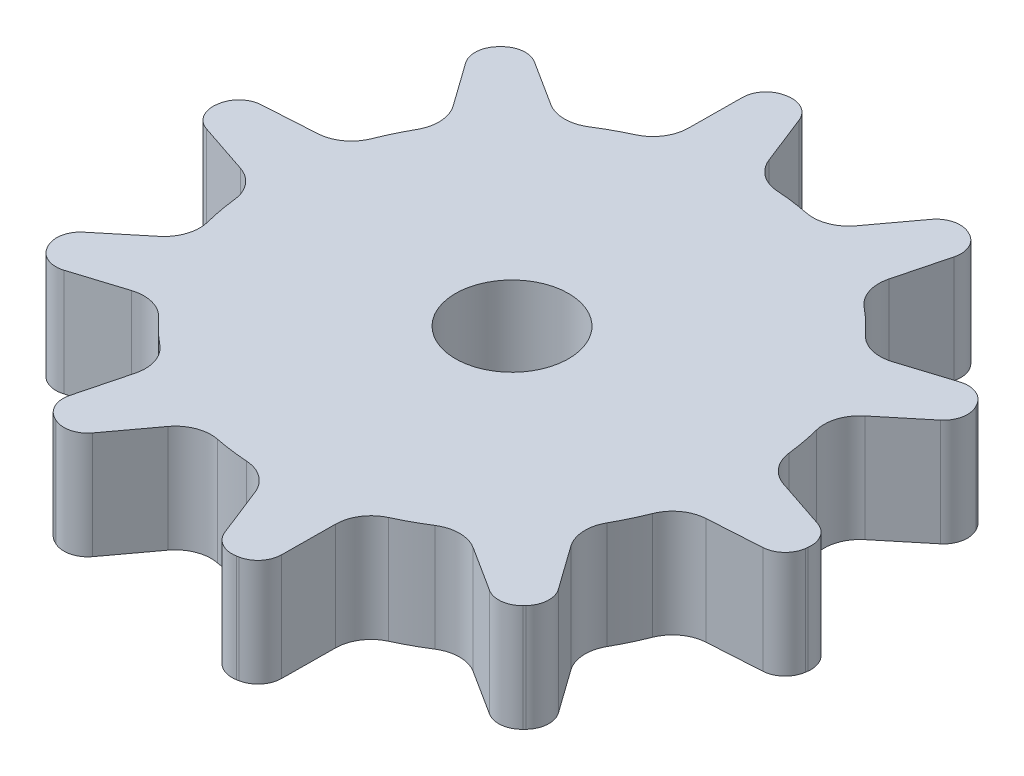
ISO-10303-21;
HEADER;
FILE_DESCRIPTION(('STEP AP214'),'2;1');
FILE_NAME('part.step','',(''),(''),'','','');
FILE_SCHEMA(('AUTOMOTIVE_DESIGN { 1 0 10303 214 1 1 1 1 }'));
ENDSEC;
DATA;
#1=APPLICATION_CONTEXT('core data for automotive mechanical design processes');
#2=APPLICATION_PROTOCOL_DEFINITION('international standard','automotive_design',2000,#1);
#3=PRODUCT_CONTEXT('',#1,'mechanical');
#4=PRODUCT('Part','Part','',(#3));
#5=PRODUCT_RELATED_PRODUCT_CATEGORY('part','',(#4));
#6=PRODUCT_DEFINITION_FORMATION('','',#4);
#7=PRODUCT_DEFINITION_CONTEXT('part definition',#1,'design');
#8=PRODUCT_DEFINITION('design','',#6,#7);
#9=PRODUCT_DEFINITION_SHAPE('','',#8);
#10=(LENGTH_UNIT() NAMED_UNIT(*) SI_UNIT(.MILLI.,.METRE.));
#11=(NAMED_UNIT(*) PLANE_ANGLE_UNIT() SI_UNIT($,.RADIAN.));
#12=(NAMED_UNIT(*) SI_UNIT($,.STERADIAN.) SOLID_ANGLE_UNIT());
#13=UNCERTAINTY_MEASURE_WITH_UNIT(LENGTH_MEASURE(1.E-05),#10,'distance_accuracy_value','');
#14=(GEOMETRIC_REPRESENTATION_CONTEXT(3) GLOBAL_UNCERTAINTY_ASSIGNED_CONTEXT((#13)) GLOBAL_UNIT_ASSIGNED_CONTEXT((#10,
#11,#12)) REPRESENTATION_CONTEXT('',''));
#15=CARTESIAN_POINT('',(0.,0.,0.));
#16=DIRECTION('',(0.,0.,1.));
#17=DIRECTION('',(1.,0.,0.));
#18=AXIS2_PLACEMENT_3D('',#15,#16,#17);
#19=CARTESIAN_POINT('',(0.,9.,0.));
#20=DIRECTION('',(0.,-1.,0.));
#21=DIRECTION('',(-0.182235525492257,0.,-0.983254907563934));
#22=AXIS2_PLACEMENT_3D('',#19,#20,#21);
#23=CYLINDRICAL_SURFACE('',#22,28.75);
#24=CARTESIAN_POINT('',(0.,0.,0.));
#25=DIRECTION('',(0.,1.,0.));
#26=DIRECTION('',(0.182235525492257,0.,0.983254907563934));
#27=AXIS2_PLACEMENT_3D('',#24,#25,#26);
#28=CIRCLE('',#27,28.75);
#29=CARTESIAN_POINT('',(-25.3067887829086,0.,13.6429081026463));
#30=VERTEX_POINT('',#29);
#31=CARTESIAN_POINT('',(-25.2249705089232,0.,13.7935986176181));
#32=VERTEX_POINT('',#31);
#33=EDGE_CURVE('E1135',#30,#32,#28,.T.);
#34=ORIENTED_EDGE('',*,*,#33,.T.);
#35=DIRECTION('',(0.,-1.,0.));
#36=VECTOR('',#35,1.);
#37=CARTESIAN_POINT('',(-25.2249705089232,9.,13.7935986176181));
#38=LINE('',#37,#36);
#39=CARTESIAN_POINT('',(-25.2249705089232,9.,13.7935986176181));
#40=VERTEX_POINT('',#39);
#41=EDGE_CURVE('E1004',#32,#40,#38,.F.);
#42=ORIENTED_EDGE('',*,*,#41,.T.);
#43=CARTESIAN_POINT('',(0.,9.,0.));
#44=DIRECTION('',(0.,1.,0.));
#45=DIRECTION('',(0.182235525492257,0.,0.983254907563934));
#46=AXIS2_PLACEMENT_3D('',#43,#44,#45);
#47=CIRCLE('',#46,28.75);
#48=CARTESIAN_POINT('',(-25.3067887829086,9.,13.6429081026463));
#49=VERTEX_POINT('',#48);
#50=EDGE_CURVE('E1354',#49,#40,#47,.T.);
#51=ORIENTED_EDGE('',*,*,#50,.F.);
#52=DIRECTION('',(0.,-1.,0.));
#53=VECTOR('',#52,1.);
#54=CARTESIAN_POINT('',(-25.3067887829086,9.,13.6429081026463));
#55=LINE('',#54,#53);
#56=EDGE_CURVE('E1002',#49,#30,#55,.T.);
#57=ORIENTED_EDGE('',*,*,#56,.T.);
#58=EDGE_LOOP('',(#34,#42,#51,#57));
#59=FACE_BOUND('',#58,.T.);
#60=ADVANCED_FACE('F39',(#59),#23,.T.);
#61=CARTESIAN_POINT('',(-12.4545220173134,0.,25.9123017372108));
#62=VERTEX_POINT('',#61);
#63=CARTESIAN_POINT('',(-12.299755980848,0.,25.9861213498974));
#64=VERTEX_POINT('',#63);
#65=EDGE_CURVE('E1140',#62,#64,#28,.T.);
#66=ORIENTED_EDGE('',*,*,#65,.T.);
#67=DIRECTION('',(0.,-1.,0.));
#68=VECTOR('',#67,1.);
#69=CARTESIAN_POINT('',(-12.299755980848,9.,25.9861213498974));
#70=LINE('',#69,#68);
#71=CARTESIAN_POINT('',(-12.299755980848,9.,25.9861213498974));
#72=VERTEX_POINT('',#71);
#73=EDGE_CURVE('E986',#64,#72,#70,.F.);
#74=ORIENTED_EDGE('',*,*,#73,.T.);
#75=CARTESIAN_POINT('',(-12.4545220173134,9.,25.9123017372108));
#76=VERTEX_POINT('',#75);
#77=EDGE_CURVE('E1355',#76,#72,#47,.T.);
#78=ORIENTED_EDGE('',*,*,#77,.F.);
#79=DIRECTION('',(0.,-1.,0.));
#80=VECTOR('',#79,1.);
#81=CARTESIAN_POINT('',(-12.4545220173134,9.,25.9123017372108));
#82=LINE('',#81,#80);
#83=EDGE_CURVE('E984',#76,#62,#82,.T.);
#84=ORIENTED_EDGE('',*,*,#83,.T.);
#85=EDGE_LOOP('',(#66,#74,#78,#84));
#86=FACE_BOUND('',#85,.T.);
#87=ADVANCED_FACE('F1210',(#86),#23,.T.);
#88=CARTESIAN_POINT('',(-28.4927223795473,0.,-3.83761272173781));
#89=VERTEX_POINT('',#88);
#90=CARTESIAN_POINT('',(-28.5151036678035,0.,-3.66760995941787));
#91=VERTEX_POINT('',#90);
#92=EDGE_CURVE('E1057',#89,#91,#28,.T.);
#93=ORIENTED_EDGE('',*,*,#92,.T.);
#94=DIRECTION('',(0.,-1.,0.));
#95=VECTOR('',#94,1.);
#96=CARTESIAN_POINT('',(-28.5151036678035,9.,-3.66760995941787));
#97=LINE('',#96,#95);
#98=CARTESIAN_POINT('',(-28.5151036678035,9.,-3.66760995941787));
#99=VERTEX_POINT('',#98);
#100=EDGE_CURVE('E1022',#91,#99,#97,.F.);
#101=ORIENTED_EDGE('',*,*,#100,.T.);
#102=CARTESIAN_POINT('',(-28.4927223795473,9.,-3.83761272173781));
#103=VERTEX_POINT('',#102);
#104=EDGE_CURVE('E1199',#103,#99,#47,.T.);
#105=ORIENTED_EDGE('',*,*,#104,.F.);
#106=DIRECTION('',(0.,-1.,0.));
#107=VECTOR('',#106,1.);
#108=CARTESIAN_POINT('',(-28.4927223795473,9.,-3.83761272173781));
#109=LINE('',#108,#107);
#110=EDGE_CURVE('E1020',#103,#89,#109,.T.);
#111=ORIENTED_EDGE('',*,*,#110,.T.);
#112=EDGE_LOOP('',(#93,#101,#105,#111));
#113=FACE_BOUND('',#112,.T.);
#114=ADVANCED_FACE('F1215',(#113),#23,.T.);
#115=CARTESIAN_POINT('',(28.4927223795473,0.,3.83761272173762));
#116=VERTEX_POINT('',#115);
#117=CARTESIAN_POINT('',(28.5151036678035,0.,3.66760995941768));
#118=VERTEX_POINT('',#117);
#119=EDGE_CURVE('E1153',#116,#118,#28,.T.);
#120=ORIENTED_EDGE('',*,*,#119,.T.);
#121=DIRECTION('',(0.,-1.,0.));
#122=VECTOR('',#121,1.);
#123=CARTESIAN_POINT('',(28.5151036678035,9.,3.66760995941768));
#124=LINE('',#123,#122);
#125=CARTESIAN_POINT('',(28.5151036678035,9.,3.66760995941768));
#126=VERTEX_POINT('',#125);
#127=EDGE_CURVE('E932',#118,#126,#124,.F.);
#128=ORIENTED_EDGE('',*,*,#127,.T.);
#129=CARTESIAN_POINT('',(28.4927223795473,9.,3.83761272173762));
#130=VERTEX_POINT('',#129);
#131=EDGE_CURVE('E1363',#130,#126,#47,.T.);
#132=ORIENTED_EDGE('',*,*,#131,.F.);
#133=DIRECTION('',(0.,-1.,0.));
#134=VECTOR('',#133,1.);
#135=CARTESIAN_POINT('',(28.4927223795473,9.,3.83761272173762));
#136=LINE('',#135,#134);
#137=EDGE_CURVE('E930',#130,#116,#136,.T.);
#138=ORIENTED_EDGE('',*,*,#137,.T.);
#139=EDGE_LOOP('',(#120,#128,#132,#138));
#140=FACE_BOUND('',#139,.T.);
#141=ADVANCED_FACE('F1397',(#140),#23,.T.);
#142=CARTESIAN_POINT('',(25.3067887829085,0.,-13.6429081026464));
#143=VERTEX_POINT('',#142);
#144=CARTESIAN_POINT('',(25.2249705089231,0.,-13.7935986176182));
#145=VERTEX_POINT('',#144);
#146=EDGE_CURVE('E874',#143,#145,#28,.T.);
#147=ORIENTED_EDGE('',*,*,#146,.T.);
#148=DIRECTION('',(0.,-1.,0.));
#149=VECTOR('',#148,1.);
#150=CARTESIAN_POINT('',(25.2249705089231,9.,-13.7935986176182));
#151=LINE('',#150,#149);
#152=CARTESIAN_POINT('',(25.2249705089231,9.,-13.7935986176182));
#153=VERTEX_POINT('',#152);
#154=EDGE_CURVE('E914',#145,#153,#151,.F.);
#155=ORIENTED_EDGE('',*,*,#154,.T.);
#156=CARTESIAN_POINT('',(25.3067887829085,9.,-13.6429081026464));
#157=VERTEX_POINT('',#156);
#158=EDGE_CURVE('E868',#157,#153,#47,.T.);
#159=ORIENTED_EDGE('',*,*,#158,.F.);
#160=DIRECTION('',(0.,-1.,0.));
#161=VECTOR('',#160,1.);
#162=CARTESIAN_POINT('',(25.3067887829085,9.,-13.6429081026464));
#163=LINE('',#162,#161);
#164=EDGE_CURVE('E912',#157,#143,#163,.T.);
#165=ORIENTED_EDGE('',*,*,#164,.T.);
#166=EDGE_LOOP('',(#147,#155,#159,#165));
#167=FACE_BOUND('',#166,.T.);
#168=ADVANCED_FACE('F1372',(#167),#23,.T.);
#169=CARTESIAN_POINT('',(5.15494884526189,0.,28.2840768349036));
#170=VERTEX_POINT('',#169);
#171=CARTESIAN_POINT('',(5.32354727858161,0.,28.2528289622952));
#172=VERTEX_POINT('',#171);
#173=EDGE_CURVE('E1143',#170,#172,#28,.T.);
#174=ORIENTED_EDGE('',*,*,#173,.T.);
#175=DIRECTION('',(0.,-1.,0.));
#176=VECTOR('',#175,1.);
#177=CARTESIAN_POINT('',(5.32354727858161,9.,28.2528289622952));
#178=LINE('',#177,#176);
#179=CARTESIAN_POINT('',(5.32354727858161,9.,28.2528289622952));
#180=VERTEX_POINT('',#179);
#181=EDGE_CURVE('E968',#172,#180,#178,.F.);
#182=ORIENTED_EDGE('',*,*,#181,.T.);
#183=CARTESIAN_POINT('',(5.15494884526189,9.,28.2840768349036));
#184=VERTEX_POINT('',#183);
#185=EDGE_CURVE('E1357',#184,#180,#47,.T.);
#186=ORIENTED_EDGE('',*,*,#185,.F.);
#187=DIRECTION('',(0.,-1.,0.));
#188=VECTOR('',#187,1.);
#189=CARTESIAN_POINT('',(5.15494884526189,9.,28.2840768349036));
#190=LINE('',#189,#188);
#191=EDGE_CURVE('E966',#184,#170,#190,.T.);
#192=ORIENTED_EDGE('',*,*,#191,.T.);
#193=EDGE_LOOP('',(#174,#182,#186,#192));
#194=FACE_BOUND('',#193,.T.);
#195=ADVANCED_FACE('F1234',(#194),#23,.T.);
#196=CARTESIAN_POINT('',(20.7954044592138,0.,19.8522959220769));
#197=VERTEX_POINT('',#196);
#198=CARTESIAN_POINT('',(20.9134364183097,0.,19.7279161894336));
#199=VERTEX_POINT('',#198);
#200=EDGE_CURVE('E1148',#197,#199,#28,.T.);
#201=ORIENTED_EDGE('',*,*,#200,.T.);
#202=DIRECTION('',(0.,-1.,0.));
#203=VECTOR('',#202,1.);
#204=CARTESIAN_POINT('',(20.9134364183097,9.,19.7279161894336));
#205=LINE('',#204,#203);
#206=CARTESIAN_POINT('',(20.9134364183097,9.,19.7279161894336));
#207=VERTEX_POINT('',#206);
#208=EDGE_CURVE('E950',#199,#207,#205,.F.);
#209=ORIENTED_EDGE('',*,*,#208,.T.);
#210=CARTESIAN_POINT('',(20.7954044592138,9.,19.8522959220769));
#211=VERTEX_POINT('',#210);
#212=EDGE_CURVE('E1360',#211,#207,#47,.T.);
#213=ORIENTED_EDGE('',*,*,#212,.F.);
#214=DIRECTION('',(0.,-1.,0.));
#215=VECTOR('',#214,1.);
#216=CARTESIAN_POINT('',(20.7954044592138,9.,19.8522959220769));
#217=LINE('',#216,#215);
#218=EDGE_CURVE('E948',#211,#197,#217,.T.);
#219=ORIENTED_EDGE('',*,*,#218,.T.);
#220=EDGE_LOOP('',(#201,#209,#213,#219));
#221=FACE_BOUND('',#220,.T.);
#222=ADVANCED_FACE('F1229',(#221),#23,.T.);
#223=CARTESIAN_POINT('',(12.4545220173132,0.,-25.9123017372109));
#224=VERTEX_POINT('',#223);
#225=CARTESIAN_POINT('',(12.2997559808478,0.,-25.9861213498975));
#226=VERTEX_POINT('',#225);
#227=EDGE_CURVE('E843',#224,#226,#28,.T.);
#228=ORIENTED_EDGE('',*,*,#227,.T.);
#229=DIRECTION('',(0.,-1.,0.));
#230=VECTOR('',#229,1.);
#231=CARTESIAN_POINT('',(12.2997559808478,9.,-25.9861213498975));
#232=LINE('',#231,#230);
#233=CARTESIAN_POINT('',(12.2997559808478,9.,-25.9861213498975));
#234=VERTEX_POINT('',#233);
#235=EDGE_CURVE('E896',#226,#234,#232,.F.);
#236=ORIENTED_EDGE('',*,*,#235,.T.);
#237=CARTESIAN_POINT('',(12.4545220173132,9.,-25.9123017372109));
#238=VERTEX_POINT('',#237);
#239=EDGE_CURVE('E865',#238,#234,#47,.T.);
#240=ORIENTED_EDGE('',*,*,#239,.F.);
#241=DIRECTION('',(0.,-1.,0.));
#242=VECTOR('',#241,1.);
#243=CARTESIAN_POINT('',(12.4545220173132,9.,-25.9123017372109));
#244=LINE('',#243,#242);
#245=EDGE_CURVE('E894',#238,#224,#244,.T.);
#246=ORIENTED_EDGE('',*,*,#245,.T.);
#247=EDGE_LOOP('',(#228,#236,#240,#246));
#248=FACE_BOUND('',#247,.T.);
#249=ADVANCED_FACE('F1225',(#248),#23,.T.);
#250=CARTESIAN_POINT('',(-5.1549488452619,0.,-28.2840768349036));
#251=VERTEX_POINT('',#250);
#252=CARTESIAN_POINT('',(-5.32354727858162,0.,-28.2528289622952));
#253=VERTEX_POINT('',#252);
#254=EDGE_CURVE('E869',#251,#253,#28,.T.);
#255=ORIENTED_EDGE('',*,*,#254,.T.);
#256=DIRECTION('',(0.,-1.,0.));
#257=VECTOR('',#256,1.);
#258=CARTESIAN_POINT('',(-5.32354727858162,9.,-28.2528289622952));
#259=LINE('',#258,#257);
#260=CARTESIAN_POINT('',(-5.32354727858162,9.,-28.2528289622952));
#261=VERTEX_POINT('',#260);
#262=EDGE_CURVE('E878',#253,#261,#259,.F.);
#263=ORIENTED_EDGE('',*,*,#262,.T.);
#264=CARTESIAN_POINT('',(-5.1549488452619,9.,-28.2840768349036));
#265=VERTEX_POINT('',#264);
#266=EDGE_CURVE('E871',#265,#261,#47,.T.);
#267=ORIENTED_EDGE('',*,*,#266,.F.);
#268=DIRECTION('',(0.,-1.,0.));
#269=VECTOR('',#268,1.);
#270=CARTESIAN_POINT('',(-5.1549488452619,9.,-28.2840768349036));
#271=LINE('',#270,#269);
#272=EDGE_CURVE('E876',#265,#251,#271,.T.);
#273=ORIENTED_EDGE('',*,*,#272,.T.);
#274=EDGE_LOOP('',(#255,#263,#267,#273));
#275=FACE_BOUND('',#274,.T.);
#276=ADVANCED_FACE('F1169',(#275),#23,.T.);
#277=CARTESIAN_POINT('',(-20.7954044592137,0.,-19.8522959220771));
#278=VERTEX_POINT('',#277);
#279=CARTESIAN_POINT('',(-20.9134364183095,0.,-19.7279161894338));
#280=VERTEX_POINT('',#279);
#281=EDGE_CURVE('E875',#278,#280,#28,.T.);
#282=ORIENTED_EDGE('',*,*,#281,.T.);
#283=DIRECTION('',(0.,-1.,0.));
#284=VECTOR('',#283,1.);
#285=CARTESIAN_POINT('',(-20.9134364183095,9.,-19.7279161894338));
#286=LINE('',#285,#284);
#287=CARTESIAN_POINT('',(-20.9134364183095,9.,-19.7279161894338));
#288=VERTEX_POINT('',#287);
#289=EDGE_CURVE('E1040',#280,#288,#286,.F.);
#290=ORIENTED_EDGE('',*,*,#289,.T.);
#291=CARTESIAN_POINT('',(-20.7954044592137,9.,-19.8522959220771));
#292=VERTEX_POINT('',#291);
#293=EDGE_CURVE('E870',#292,#288,#47,.T.);
#294=ORIENTED_EDGE('',*,*,#293,.F.);
#295=DIRECTION('',(0.,-1.,0.));
#296=VECTOR('',#295,1.);
#297=CARTESIAN_POINT('',(-20.7954044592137,9.,-19.852295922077));
#298=LINE('',#297,#296);
#299=EDGE_CURVE('E1038',#292,#278,#298,.T.);
#300=ORIENTED_EDGE('',*,*,#299,.T.);
#301=EDGE_LOOP('',(#282,#290,#294,#300));
#302=FACE_BOUND('',#301,.T.);
#303=ADVANCED_FACE('F1053',(#302),#23,.T.);
#304=CARTESIAN_POINT('',(11.8453091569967,9.,63.9115689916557));
#305=DIRECTION('',(0.,1.,0.));
#306=DIRECTION('',(0.182235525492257,0.,0.983254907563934));
#307=AXIS2_PLACEMENT_3D('',#304,#305,#306);
#308=PLANE('',#307);
#309=CARTESIAN_POINT('',(0.,9.,0.));
#310=DIRECTION('',(0.,1.,0.));
#311=DIRECTION('',(0.182235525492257,0.,0.983254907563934));
#312=AXIS2_PLACEMENT_3D('',#309,#310,#311);
#313=CIRCLE('',#312,4.75);
#314=CARTESIAN_POINT('',(0.865618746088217,9.,4.67046081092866));
#315=VERTEX_POINT('',#314);
#316=EDGE_CURVE('E1571',#315,#315,#313,.T.);
#317=ORIENTED_EDGE('',*,*,#316,.F.);
#318=EDGE_LOOP('',(#317));
#319=FACE_BOUND('',#318,.T.);
#320=ORIENTED_EDGE('',*,*,#293,.T.);
#321=CARTESIAN_POINT('',(-19.4585886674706,9.,-18.3555394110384));
#322=DIRECTION('',(0.,1.,0.));
#323=DIRECTION('',(0.182235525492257,0.,0.983254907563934));
#324=AXIS2_PLACEMENT_3D('',#321,#322,#323);
#325=CIRCLE('',#324,2.);
#326=CARTESIAN_POINT('',(-21.0868197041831,9.,-17.1941334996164));
#327=VERTEX_POINT('',#326);
#328=EDGE_CURVE('E1045',#288,#327,#325,.T.);
#329=ORIENTED_EDGE('',*,*,#328,.T.);
#330=DIRECTION('',(-0.580702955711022,0.,-0.81411551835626));
#331=VECTOR('',#330,1.);
#332=CARTESIAN_POINT('',(-22.013150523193,9.,-18.4928014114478));
#333=LINE('',#332,#331);
#334=CARTESIAN_POINT('',(-18.4676722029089,9.,-13.5222241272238));
#335=VERTEX_POINT('',#334);
#336=EDGE_CURVE('E556',#335,#327,#333,.T.);
#337=ORIENTED_EDGE('',*,*,#336,.F.);
#338=CARTESIAN_POINT('',(-20.9100187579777,9.,-11.7801152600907));
#339=DIRECTION('',(0.,1.,0.));
#340=DIRECTION('',(-0.725374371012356,0.,-0.688354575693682));
#341=AXIS2_PLACEMENT_3D('',#338,#339,#340);
#342=CIRCLE('',#341,3.);
#343=CARTESIAN_POINT('',(-18.2962664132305,9.,-10.3076008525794));
#344=VERTEX_POINT('',#343);
#345=EDGE_CURVE('E1063',#344,#335,#342,.T.);
#346=ORIENTED_EDGE('',*,*,#345,.F.);
#347=CARTESIAN_POINT('',(0.,9.,0.));
#348=DIRECTION('',(0.,-1.,0.));
#349=DIRECTION('',(0.991444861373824,0.,0.130526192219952));
#350=AXIS2_PLACEMENT_3D('',#347,#348,#349);
#351=CIRCLE('',#350,21.);
#352=CARTESIAN_POINT('',(-19.5247239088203,9.,-7.7320861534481));
#353=VERTEX_POINT('',#352);
#354=EDGE_CURVE('E545',#353,#344,#351,.T.);
#355=ORIENTED_EDGE('',*,*,#354,.F.);
#356=CARTESIAN_POINT('',(-22.3139701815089,9.,-8.83666988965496));
#357=DIRECTION('',(0.,1.,0.));
#358=DIRECTION('',(0.991444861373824,0.,0.130526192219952));
#359=AXIS2_PLACEMENT_3D('',#356,#357,#358);
#360=CIRCLE('',#359,3.);
#361=CARTESIAN_POINT('',(-22.130824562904,9.,-5.84226549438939));
#362=VERTEX_POINT('',#361);
#363=EDGE_CURVE('E569',#362,#353,#360,.T.);
#364=ORIENTED_EDGE('',*,*,#363,.F.);
#365=DIRECTION('',(0.998134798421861,0.,-0.061048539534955));
#366=VECTOR('',#365,1.);
#367=CARTESIAN_POINT('',(-28.2249304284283,9.,-5.46953401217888));
#368=LINE('',#367,#366);
#369=CARTESIAN_POINT('',(-26.6327170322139,9.,-5.56691795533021));
#370=VERTEX_POINT('',#369);
#371=EDGE_CURVE('E565',#370,#362,#368,.T.);
#372=ORIENTED_EDGE('',*,*,#371,.F.);
#373=CARTESIAN_POINT('',(-26.510619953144,9.,-3.57064835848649));
#374=DIRECTION('',(0.,1.,0.));
#375=DIRECTION('',(0.182235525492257,0.,0.983254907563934));
#376=AXIS2_PLACEMENT_3D('',#373,#374,#375);
#377=CIRCLE('',#376,2.);
#378=EDGE_CURVE('E1025',#370,#103,#377,.T.);
#379=ORIENTED_EDGE('',*,*,#378,.T.);
#380=ORIENTED_EDGE('',*,*,#104,.T.);
#381=CARTESIAN_POINT('',(-26.5314442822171,9.,-3.41247187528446));
#382=DIRECTION('',(0.,1.,0.));
#383=DIRECTION('',(0.182235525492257,0.,0.983254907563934));
#384=AXIS2_PLACEMENT_3D('',#381,#382,#383);
#385=CIRCLE('',#384,2.);
#386=CARTESIAN_POINT('',(-27.1660535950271,9.,-1.51582456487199));
#387=VERTEX_POINT('',#386);
#388=EDGE_CURVE('E1027',#99,#387,#385,.T.);
#389=ORIENTED_EDGE('',*,*,#388,.T.);
#390=DIRECTION('',(-0.948323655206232,0.,-0.317304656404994));
#391=VECTOR('',#390,1.);
#392=CARTESIAN_POINT('',(-28.6788088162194,9.,-2.02198538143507));
#393=LINE('',#392,#391);
#394=CARTESIAN_POINT('',(-22.8888245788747,9.,-0.0846837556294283));
#395=VERTEX_POINT('',#394);
#396=EDGE_CURVE('E1075',#395,#387,#393,.T.);
#397=ORIENTED_EDGE('',*,*,#396,.F.);
#398=CARTESIAN_POINT('',(-23.8407385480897,9.,2.76028720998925));
#399=DIRECTION('',(0.,1.,0.));
#400=DIRECTION('',(-0.991444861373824,0.,-0.130526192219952));
#401=AXIS2_PLACEMENT_3D('',#398,#399,#400);
#402=CIRCLE('',#401,3.);
#403=CARTESIAN_POINT('',(-20.8606462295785,9.,2.41525130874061));
#404=VERTEX_POINT('',#403);
#405=EDGE_CURVE('E1079',#404,#395,#402,.T.);
#406=ORIENTED_EDGE('',*,*,#405,.F.);
#407=CARTESIAN_POINT('',(0.,9.,0.));
#408=DIRECTION('',(0.,-1.,0.));
#409=DIRECTION('',(0.878817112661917,0.,-0.477158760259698));
#410=AXIS2_PLACEMENT_3D('',#407,#408,#409);
#411=CIRCLE('',#410,21.);
#412=CARTESIAN_POINT('',(-20.3406396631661,9.,5.22095566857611));
#413=VERTEX_POINT('',#412);
#414=EDGE_CURVE('E612',#413,#404,#411,.T.);
#415=ORIENTED_EDGE('',*,*,#414,.F.);
#416=CARTESIAN_POINT('',(-23.2464453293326,9.,5.96680647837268));
#417=DIRECTION('',(0.,1.,0.));
#418=DIRECTION('',(0.878817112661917,0.,-0.477158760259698));
#419=AXIS2_PLACEMENT_3D('',#416,#417,#418);
#420=CIRCLE('',#419,3.);
#421=CARTESIAN_POINT('',(-21.3382106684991,9.,8.28168022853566));
#422=VERTEX_POINT('',#421);
#423=EDGE_CURVE('E609',#422,#413,#420,.T.);
#424=ORIENTED_EDGE('',*,*,#423,.F.);
#425=DIRECTION('',(0.771624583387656,0.,-0.636078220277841));
#426=VECTOR('',#425,1.);
#427=CARTESIAN_POINT('',(-26.0493598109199,9.,12.1652518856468));
#428=LINE('',#427,#426);
#429=CARTESIAN_POINT('',(-24.8184729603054,9.,11.1505870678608));
#430=VERTEX_POINT('',#429);
#431=EDGE_CURVE('E603',#430,#422,#428,.T.);
#432=ORIENTED_EDGE('',*,*,#431,.F.);
#433=CARTESIAN_POINT('',(-23.5463165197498,9.,12.6938362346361));
#434=DIRECTION('',(0.,1.,0.));
#435=DIRECTION('',(0.182235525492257,0.,0.983254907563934));
#436=AXIS2_PLACEMENT_3D('',#433,#434,#435);
#437=CIRCLE('',#436,2.);
#438=EDGE_CURVE('E1007',#430,#49,#437,.T.);
#439=ORIENTED_EDGE('',*,*,#438,.T.);
#440=ORIENTED_EDGE('',*,*,#50,.T.);
#441=CARTESIAN_POINT('',(-23.4701899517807,9.,12.8340439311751));
#442=DIRECTION('',(0.,1.,0.));
#443=DIRECTION('',(0.182235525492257,0.,0.983254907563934));
#444=AXIS2_PLACEMENT_3D('',#441,#442,#443);
#445=CIRCLE('',#444,2.);
#446=CARTESIAN_POINT('',(-22.868778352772,9.,14.7414778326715));
#447=VERTEX_POINT('',#446);
#448=EDGE_CURVE('E1009',#40,#447,#445,.T.);
#449=ORIENTED_EDGE('',*,*,#448,.T.);
#450=DIRECTION('',(-0.953716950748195,0.,0.300705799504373));
#451=VECTOR('',#450,1.);
#452=CARTESIAN_POINT('',(-24.39013689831,9.,15.2211603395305));
#453=LINE('',#452,#451);
#454=CARTESIAN_POINT('',(-18.5672239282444,9.,13.3852029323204));
#455=VERTEX_POINT('',#454);
#456=EDGE_CURVE('E1106',#455,#447,#453,.T.);
#457=ORIENTED_EDGE('',*,*,#456,.F.);
#458=CARTESIAN_POINT('',(-17.6651065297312,9.,16.246353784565));
#459=DIRECTION('',(0.,1.,0.));
#460=DIRECTION('',(-0.878817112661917,0.,0.477158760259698));
#461=AXIS2_PLACEMENT_3D('',#458,#459,#460);
#462=CIRCLE('',#461,3.);
#463=CARTESIAN_POINT('',(-15.4569682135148,9.,14.2155595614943));
#464=VERTEX_POINT('',#463);
#465=EDGE_CURVE('E578',#464,#455,#462,.T.);
#466=ORIENTED_EDGE('',*,*,#465,.F.);
#467=CARTESIAN_POINT('',(0.,9.,0.));
#468=DIRECTION('',(0.,-1.,0.));
#469=DIRECTION('',(0.430511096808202,0.,-0.902585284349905));
#470=AXIS2_PLACEMENT_3D('',#467,#468,#469);
#471=CIRCLE('',#470,21.);
#472=CARTESIAN_POINT('',(-13.3871224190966,9.,16.1797698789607));
#473=VERTEX_POINT('',#472);
#474=EDGE_CURVE('E650',#473,#464,#471,.T.);
#475=ORIENTED_EDGE('',*,*,#474,.F.);
#476=CARTESIAN_POINT('',(-15.2995684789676,9.,18.491165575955));
#477=DIRECTION('',(0.,1.,0.));
#478=DIRECTION('',(0.430511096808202,0.,-0.902585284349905));
#479=AXIS2_PLACEMENT_3D('',#476,#477,#478);
#480=CIRCLE('',#479,3.);
#481=CARTESIAN_POINT('',(-12.3951255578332,9.,19.2423055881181));
#482=VERTEX_POINT('',#481);
#483=EDGE_CURVE('E596',#482,#473,#480,.T.);
#484=ORIENTED_EDGE('',*,*,#483,.F.);
#485=DIRECTION('',(0.250380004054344,0.,-0.968147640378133));
#486=VECTOR('',#485,1.);
#487=CARTESIAN_POINT('',(-13.9238191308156,9.,25.1533250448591));
#488=LINE('',#487,#486);
#489=CARTESIAN_POINT('',(-13.5244157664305,9.,23.608946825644));
#490=VERTEX_POINT('',#489);
#491=EDGE_CURVE('E642',#490,#482,#488,.T.);
#492=ORIENTED_EDGE('',*,*,#491,.F.);
#493=CARTESIAN_POINT('',(-11.5881204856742,9.,24.1097068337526));
#494=DIRECTION('',(0.,1.,0.));
#495=DIRECTION('',(0.182235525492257,0.,0.983254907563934));
#496=AXIS2_PLACEMENT_3D('',#493,#494,#495);
#497=CIRCLE('',#496,2.);
#498=EDGE_CURVE('E989',#490,#76,#497,.T.);
#499=ORIENTED_EDGE('',*,*,#498,.T.);
#500=ORIENTED_EDGE('',*,*,#77,.T.);
#501=CARTESIAN_POINT('',(-11.4441207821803,9.,24.178391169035));
#502=DIRECTION('',(0.,1.,0.));
#503=DIRECTION('',(0.182235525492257,0.,0.983254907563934));
#504=AXIS2_PLACEMENT_3D('',#501,#502,#503);
#505=CIRCLE('',#504,2.);
#506=CARTESIAN_POINT('',(-9.83640706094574,9.,25.3680367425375));
#507=VERTEX_POINT('',#506);
#508=EDGE_CURVE('E991',#72,#507,#505,.T.);
#509=ORIENTED_EDGE('',*,*,#508,.T.);
#510=DIRECTION('',(-0.594822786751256,0.,0.80385686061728));
#511=VECTOR('',#510,1.);
#512=CARTESIAN_POINT('',(-10.7852616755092,9.,26.6503401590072));
#513=LINE('',#512,#511);
#514=CARTESIAN_POINT('',(-7.15357481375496,9.,21.7423970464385));
#515=VERTEX_POINT('',#514);
#516=EDGE_CURVE('E584',#515,#507,#513,.T.);
#517=ORIENTED_EDGE('',*,*,#516,.F.);
#518=CARTESIAN_POINT('',(-4.74200423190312,9.,23.5268654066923));
#519=DIRECTION('',(0.,1.,0.));
#520=DIRECTION('',(-0.430511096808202,0.,0.902585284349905));
#521=AXIS2_PLACEMENT_3D('',#518,#519,#520);
#522=CIRCLE('',#521,3.);
#523=CARTESIAN_POINT('',(-4.14925370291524,9.,20.5860072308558));
#524=VERTEX_POINT('',#523);
#525=EDGE_CURVE('E588',#524,#515,#522,.T.);
#526=ORIENTED_EDGE('',*,*,#525,.F.);
#527=CARTESIAN_POINT('',(0.,9.,0.));
#528=DIRECTION('',(0.,-1.,0.));
#529=DIRECTION('',(-0.182235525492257,0.,-0.983254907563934));
#530=AXIS2_PLACEMENT_3D('',#527,#528,#529);
#531=CIRCLE('',#530,21.);
#532=CARTESIAN_POINT('',(-1.32017942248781,9.,20.958461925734));
#533=VERTEX_POINT('',#532);
#534=EDGE_CURVE('E687',#533,#524,#531,.T.);
#535=ORIENTED_EDGE('',*,*,#534,.F.);
#536=CARTESIAN_POINT('',(-1.50877648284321,9.,23.9525279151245));
#537=DIRECTION('',(0.,1.,0.));
#538=DIRECTION('',(-0.182235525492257,0.,-0.983254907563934));
#539=AXIS2_PLACEMENT_3D('',#536,#537,#538);
#540=CIRCLE('',#539,3.);
#541=CARTESIAN_POINT('',(1.28247622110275,9.,22.8530242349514));
#542=VERTEX_POINT('',#541);
#543=EDGE_CURVE('E635',#542,#533,#540,.T.);
#544=ORIENTED_EDGE('',*,*,#543,.F.);
#545=DIRECTION('',(-0.366501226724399,0.,-0.930417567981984));
#546=VECTOR('',#545,1.);
#547=CARTESIAN_POINT('',(3.52014720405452,9.,28.5336829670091));
#548=LINE('',#547,#546);
#549=CARTESIAN_POINT('',(2.93550857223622,9.,27.04949133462));
#550=VERTEX_POINT('',#549);
#551=EDGE_CURVE('E679',#550,#542,#548,.T.);
#552=ORIENTED_EDGE('',*,*,#551,.F.);
#553=CARTESIAN_POINT('',(4.79634370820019,9.,26.3164888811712));
#554=DIRECTION('',(0.,1.,0.));
#555=DIRECTION('',(0.182235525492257,0.,0.983254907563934));
#556=AXIS2_PLACEMENT_3D('',#553,#554,#555);
#557=CIRCLE('',#556,2.);
#558=EDGE_CURVE('E971',#550,#184,#557,.T.);
#559=ORIENTED_EDGE('',*,*,#558,.T.);
#560=ORIENTED_EDGE('',*,*,#185,.T.);
#561=CARTESIAN_POINT('',(4.95321355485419,9.,26.2874147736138));
#562=DIRECTION('',(0.,1.,0.));
#563=DIRECTION('',(0.182235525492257,0.,0.983254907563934));
#564=AXIS2_PLACEMENT_3D('',#561,#562,#563);
#565=CIRCLE('',#564,2.);
#566=CARTESIAN_POINT('',(6.95313740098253,9.,26.3048678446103));
#567=VERTEX_POINT('',#566);
#568=EDGE_CURVE('E973',#180,#567,#565,.T.);
#569=ORIENTED_EDGE('',*,*,#568,.T.);
#570=DIRECTION('',(-0.00872653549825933,0.,0.999961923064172));
#571=VECTOR('',#570,1.);
#572=CARTESIAN_POINT('',(6.9392169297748,9.,27.8999958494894));
#573=LINE('',#572,#571);
#574=CARTESIAN_POINT('',(6.99249673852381,9.,21.7947344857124));
#575=VERTEX_POINT('',#574);
#576=EDGE_CURVE('E623',#575,#567,#573,.T.);
#577=ORIENTED_EDGE('',*,*,#576,.F.);
#578=CARTESIAN_POINT('',(9.99238250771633,9.,21.8209140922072));
#579=DIRECTION('',(0.,1.,0.));
#580=DIRECTION('',(0.182235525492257,0.,0.983254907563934));
#581=AXIS2_PLACEMENT_3D('',#578,#579,#580);
#582=CIRCLE('',#581,3.);
#583=CARTESIAN_POINT('',(8.74333469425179,9.,19.0932998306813));
#584=VERTEX_POINT('',#583);
#585=EDGE_CURVE('E627',#584,#575,#582,.T.);
#586=ORIENTED_EDGE('',*,*,#585,.F.);
#587=CARTESIAN_POINT('',(0.,9.,0.));
#588=DIRECTION('',(0.,-1.,0.));
#589=DIRECTION('',(-0.725374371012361,0.,-0.688354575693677));
#590=AXIS2_PLACEMENT_3D('',#587,#588,#589);
#591=CIRCLE('',#590,21.);
#592=CARTESIAN_POINT('',(11.2510272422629,9.,17.7317338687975));
#593=VERTEX_POINT('',#592);
#594=EDGE_CURVE('E724',#593,#584,#591,.T.);
#595=ORIENTED_EDGE('',*,*,#594,.F.);
#596=CARTESIAN_POINT('',(12.8583168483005,9.,20.2648387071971));
#597=DIRECTION('',(0.,1.,0.));
#598=DIRECTION('',(-0.725374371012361,0.,-0.688354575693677));
#599=AXIS2_PLACEMENT_3D('',#596,#597,#598);
#600=CIRCLE('',#599,3.);
#601=CARTESIAN_POINT('',(14.4702156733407,9.,17.7346643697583));
#602=VERTEX_POINT('',#601);
#603=EDGE_CURVE('E672',#602,#593,#600,.T.);
#604=ORIENTED_EDGE('',*,*,#603,.F.);
#605=DIRECTION('',(-0.843391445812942,0.,-0.537299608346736));
#606=VECTOR('',#605,1.);
#607=CARTESIAN_POINT('',(19.6195369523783,9.,21.0151438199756));
#608=LINE('',#607,#606);
#609=CARTESIAN_POINT('',(18.274168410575,9.,20.158049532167));
#610=VERTEX_POINT('',#609);
#611=EDGE_CURVE('E716',#610,#602,#608,.T.);
#612=ORIENTED_EDGE('',*,*,#611,.F.);
#613=CARTESIAN_POINT('',(19.3487676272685,9.,18.4712666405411));
#614=DIRECTION('',(0.,1.,0.));
#615=DIRECTION('',(0.182235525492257,0.,0.983254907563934));
#616=AXIS2_PLACEMENT_3D('',#613,#614,#615);
#617=CIRCLE('',#616,2.);
#618=EDGE_CURVE('E953',#610,#211,#617,.T.);
#619=ORIENTED_EDGE('',*,*,#618,.T.);
#620=ORIENTED_EDGE('',*,*,#212,.T.);
#621=CARTESIAN_POINT('',(19.4585886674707,9.,18.3555394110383));
#622=DIRECTION('',(0.,1.,0.));
#623=DIRECTION('',(0.182235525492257,0.,0.983254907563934));
#624=AXIS2_PLACEMENT_3D('',#621,#622,#623);
#625=CIRCLE('',#624,2.);
#626=CARTESIAN_POINT('',(21.0868197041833,9.,17.1941334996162));
#627=VERTEX_POINT('',#626);
#628=EDGE_CURVE('E955',#207,#627,#625,.T.);
#629=ORIENTED_EDGE('',*,*,#628,.T.);
#630=DIRECTION('',(0.580702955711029,0.,0.814115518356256));
#631=VECTOR('',#630,1.);
#632=CARTESIAN_POINT('',(22.0131505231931,9.,18.4928014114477));
#633=LINE('',#632,#631);
#634=CARTESIAN_POINT('',(18.467672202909,9.,13.5222241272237));
#635=VERTEX_POINT('',#634);
#636=EDGE_CURVE('E660',#635,#627,#633,.T.);
#637=ORIENTED_EDGE('',*,*,#636,.F.);
#638=CARTESIAN_POINT('',(20.9100187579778,9.,11.7801152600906));
#639=DIRECTION('',(0.,1.,0.));
#640=DIRECTION('',(0.725374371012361,0.,0.688354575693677));
#641=AXIS2_PLACEMENT_3D('',#638,#639,#640);
#642=CIRCLE('',#641,3.);
#643=CARTESIAN_POINT('',(18.2962664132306,9.,10.3076008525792));
#644=VERTEX_POINT('',#643);
#645=EDGE_CURVE('E664',#644,#635,#642,.T.);
#646=ORIENTED_EDGE('',*,*,#645,.F.);
#647=CARTESIAN_POINT('',(0.,9.,0.));
#648=DIRECTION('',(0.,-1.,0.));
#649=DIRECTION('',(-0.991444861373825,0.,-0.130526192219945));
#650=AXIS2_PLACEMENT_3D('',#647,#648,#649);
#651=CIRCLE('',#650,21.);
#652=CARTESIAN_POINT('',(19.5247239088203,9.,7.73208615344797));
#653=VERTEX_POINT('',#652);
#654=EDGE_CURVE('E761',#653,#644,#651,.T.);
#655=ORIENTED_EDGE('',*,*,#654,.F.);
#656=CARTESIAN_POINT('',(22.3139701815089,9.,8.83666988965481));
#657=DIRECTION('',(0.,1.,0.));
#658=DIRECTION('',(-0.991444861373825,0.,-0.130526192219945));
#659=AXIS2_PLACEMENT_3D('',#656,#657,#658);
#660=CIRCLE('',#659,3.);
#661=CARTESIAN_POINT('',(22.130824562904,9.,5.84226549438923));
#662=VERTEX_POINT('',#661);
#663=EDGE_CURVE('E709',#662,#653,#660,.T.);
#664=ORIENTED_EDGE('',*,*,#663,.F.);
#665=DIRECTION('',(-0.998134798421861,0.,0.061048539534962));
#666=VECTOR('',#665,1.);
#667=CARTESIAN_POINT('',(28.2249304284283,9.,5.46953401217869));
#668=LINE('',#667,#666);
#669=CARTESIAN_POINT('',(26.632717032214,9.,5.56691795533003));
#670=VERTEX_POINT('',#669);
#671=EDGE_CURVE('E753',#670,#662,#668,.T.);
#672=ORIENTED_EDGE('',*,*,#671,.F.);
#673=CARTESIAN_POINT('',(26.510619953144,9.,3.57064835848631));
#674=DIRECTION('',(0.,1.,0.));
#675=DIRECTION('',(0.182235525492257,0.,0.983254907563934));
#676=AXIS2_PLACEMENT_3D('',#673,#674,#675);
#677=CIRCLE('',#676,2.);
#678=EDGE_CURVE('E935',#670,#130,#677,.T.);
#679=ORIENTED_EDGE('',*,*,#678,.T.);
#680=ORIENTED_EDGE('',*,*,#131,.T.);
#681=CARTESIAN_POINT('',(26.5314442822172,9.,3.41247187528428));
#682=DIRECTION('',(0.,1.,0.));
#683=DIRECTION('',(0.182235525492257,0.,0.983254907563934));
#684=AXIS2_PLACEMENT_3D('',#681,#682,#683);
#685=CIRCLE('',#684,2.);
#686=CARTESIAN_POINT('',(27.1660535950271,9.,1.51582456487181));
#687=VERTEX_POINT('',#686);
#688=EDGE_CURVE('E937',#126,#687,#685,.T.);
#689=ORIENTED_EDGE('',*,*,#688,.T.);
#690=DIRECTION('',(0.948323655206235,0.,0.317304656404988));
#691=VECTOR('',#690,1.);
#692=CARTESIAN_POINT('',(28.6788088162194,9.,2.02198538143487));
#693=LINE('',#692,#691);
#694=CARTESIAN_POINT('',(22.8888245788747,9.,0.0846837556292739));
#695=VERTEX_POINT('',#694);
#696=EDGE_CURVE('E697',#695,#687,#693,.T.);
#697=ORIENTED_EDGE('',*,*,#696,.F.);
#698=CARTESIAN_POINT('',(23.8407385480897,9.,-2.76028720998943));
#699=DIRECTION('',(0.,1.,0.));
#700=DIRECTION('',(0.991444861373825,0.,0.130526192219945));
#701=AXIS2_PLACEMENT_3D('',#698,#699,#700);
#702=CIRCLE('',#701,3.);
#703=CARTESIAN_POINT('',(20.8606462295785,9.,-2.41525130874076));
#704=VERTEX_POINT('',#703);
#705=EDGE_CURVE('E701',#704,#695,#702,.T.);
#706=ORIENTED_EDGE('',*,*,#705,.F.);
#707=CARTESIAN_POINT('',(0.,9.,0.));
#708=DIRECTION('',(0.,-1.,0.));
#709=DIRECTION('',(-0.878817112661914,0.,0.477158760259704));
#710=AXIS2_PLACEMENT_3D('',#707,#708,#709);
#711=CIRCLE('',#710,21.);
#712=CARTESIAN_POINT('',(20.340639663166,9.,-5.22095566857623));
#713=VERTEX_POINT('',#712);
#714=EDGE_CURVE('E798',#713,#704,#711,.T.);
#715=ORIENTED_EDGE('',*,*,#714,.F.);
#716=CARTESIAN_POINT('',(23.2464453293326,9.,-5.96680647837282));
#717=DIRECTION('',(0.,1.,0.));
#718=DIRECTION('',(-0.878817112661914,0.,0.477158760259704));
#719=AXIS2_PLACEMENT_3D('',#716,#717,#718);
#720=CIRCLE('',#719,3.);
#721=CARTESIAN_POINT('',(21.338210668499,9.,-8.28168022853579));
#722=VERTEX_POINT('',#721);
#723=EDGE_CURVE('E746',#722,#713,#720,.T.);
#724=ORIENTED_EDGE('',*,*,#723,.F.);
#725=DIRECTION('',(-0.771624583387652,0.,0.636078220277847));
#726=VECTOR('',#725,1.);
#727=CARTESIAN_POINT('',(26.0493598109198,9.,-12.1652518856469));
#728=LINE('',#727,#726);
#729=CARTESIAN_POINT('',(24.8184729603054,9.,-11.1505870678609));
#730=VERTEX_POINT('',#729);
#731=EDGE_CURVE('E790',#730,#722,#728,.T.);
#732=ORIENTED_EDGE('',*,*,#731,.F.);
#733=CARTESIAN_POINT('',(23.5463165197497,9.,-12.6938362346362));
#734=DIRECTION('',(0.,1.,0.));
#735=DIRECTION('',(0.182235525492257,0.,0.983254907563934));
#736=AXIS2_PLACEMENT_3D('',#733,#734,#735);
#737=CIRCLE('',#736,2.);
#738=EDGE_CURVE('E917',#730,#157,#737,.T.);
#739=ORIENTED_EDGE('',*,*,#738,.T.);
#740=ORIENTED_EDGE('',*,*,#158,.T.);
#741=CARTESIAN_POINT('',(23.4701899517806,9.,-12.8340439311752));
#742=DIRECTION('',(0.,1.,0.));
#743=DIRECTION('',(0.182235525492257,0.,0.983254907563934));
#744=AXIS2_PLACEMENT_3D('',#741,#742,#743);
#745=CIRCLE('',#744,2.);
#746=CARTESIAN_POINT('',(22.8687783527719,9.,-14.7414778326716));
#747=VERTEX_POINT('',#746);
#748=EDGE_CURVE('E919',#153,#747,#745,.T.);
#749=ORIENTED_EDGE('',*,*,#748,.T.);
#750=DIRECTION('',(0.953716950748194,0.,-0.30070579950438));
#751=VECTOR('',#750,1.);
#752=CARTESIAN_POINT('',(24.3901368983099,9.,-15.2211603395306));
#753=LINE('',#752,#751);
#754=CARTESIAN_POINT('',(18.5672239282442,9.,-13.3852029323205));
#755=VERTEX_POINT('',#754);
#756=EDGE_CURVE('E734',#755,#747,#753,.T.);
#757=ORIENTED_EDGE('',*,*,#756,.F.);
#758=CARTESIAN_POINT('',(17.6651065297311,9.,-16.2463537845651));
#759=DIRECTION('',(0.,1.,0.));
#760=DIRECTION('',(0.878817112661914,0.,-0.477158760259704));
#761=AXIS2_PLACEMENT_3D('',#758,#759,#760);
#762=CIRCLE('',#761,3.);
#763=CARTESIAN_POINT('',(15.4569682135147,9.,-14.2155595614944));
#764=VERTEX_POINT('',#763);
#765=EDGE_CURVE('E738',#764,#755,#762,.T.);
#766=ORIENTED_EDGE('',*,*,#765,.F.);
#767=CARTESIAN_POINT('',(0.,9.,0.));
#768=DIRECTION('',(0.,-1.,0.));
#769=DIRECTION('',(-0.430511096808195,0.,0.902585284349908));
#770=AXIS2_PLACEMENT_3D('',#767,#768,#769);
#771=CIRCLE('',#770,21.);
#772=CARTESIAN_POINT('',(13.3871224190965,9.,-16.1797698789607));
#773=VERTEX_POINT('',#772);
#774=EDGE_CURVE('E816',#773,#764,#771,.T.);
#775=ORIENTED_EDGE('',*,*,#774,.F.);
#776=CARTESIAN_POINT('',(15.2995684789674,9.,-18.4911655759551));
#777=DIRECTION('',(0.,1.,0.));
#778=DIRECTION('',(-0.430511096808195,0.,0.902585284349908));
#779=AXIS2_PLACEMENT_3D('',#776,#777,#778);
#780=CIRCLE('',#779,3.);
#781=CARTESIAN_POINT('',(12.395125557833,9.,-19.2423055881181));
#782=VERTEX_POINT('',#781);
#783=EDGE_CURVE('E783',#782,#773,#780,.T.);
#784=ORIENTED_EDGE('',*,*,#783,.F.);
#785=DIRECTION('',(-0.250380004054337,0.,0.968147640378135));
#786=VECTOR('',#785,1.);
#787=CARTESIAN_POINT('',(13.9238191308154,9.,-25.1533250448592));
#788=LINE('',#787,#786);
#789=CARTESIAN_POINT('',(13.5244157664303,9.,-23.608946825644));
#790=VERTEX_POINT('',#789);
#791=EDGE_CURVE('E808',#790,#782,#788,.T.);
#792=ORIENTED_EDGE('',*,*,#791,.F.);
#793=CARTESIAN_POINT('',(11.588120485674,9.,-24.1097068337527));
#794=DIRECTION('',(0.,1.,0.));
#795=DIRECTION('',(0.182235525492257,0.,0.983254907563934));
#796=AXIS2_PLACEMENT_3D('',#793,#794,#795);
#797=CIRCLE('',#796,2.);
#798=EDGE_CURVE('E899',#790,#238,#797,.T.);
#799=ORIENTED_EDGE('',*,*,#798,.T.);
#800=ORIENTED_EDGE('',*,*,#239,.T.);
#801=CARTESIAN_POINT('',(11.4441207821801,9.,-24.1783911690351));
#802=DIRECTION('',(0.,1.,0.));
#803=DIRECTION('',(0.182235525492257,0.,0.983254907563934));
#804=AXIS2_PLACEMENT_3D('',#801,#802,#803);
#805=CIRCLE('',#804,2.);
#806=CARTESIAN_POINT('',(9.83640706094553,9.,-25.3680367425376));
#807=VERTEX_POINT('',#806);
#808=EDGE_CURVE('E901',#234,#807,#805,.T.);
#809=ORIENTED_EDGE('',*,*,#808,.T.);
#810=DIRECTION('',(0.59482278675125,0.,-0.803856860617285));
#811=VECTOR('',#810,1.);
#812=CARTESIAN_POINT('',(10.785261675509,9.,-26.6503401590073));
#813=LINE('',#812,#811);
#814=CARTESIAN_POINT('',(7.15357481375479,9.,-21.7423970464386));
#815=VERTEX_POINT('',#814);
#816=EDGE_CURVE('E771',#815,#807,#813,.T.);
#817=ORIENTED_EDGE('',*,*,#816,.F.);
#818=CARTESIAN_POINT('',(4.74200423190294,9.,-23.5268654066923));
#819=DIRECTION('',(0.,1.,0.));
#820=DIRECTION('',(0.430511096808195,0.,-0.902585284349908));
#821=AXIS2_PLACEMENT_3D('',#818,#819,#820);
#822=CIRCLE('',#821,3.);
#823=CARTESIAN_POINT('',(4.14925370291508,9.,-20.5860072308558));
#824=VERTEX_POINT('',#823);
#825=EDGE_CURVE('E775',#824,#815,#822,.T.);
#826=ORIENTED_EDGE('',*,*,#825,.F.);
#827=CARTESIAN_POINT('',(0.,9.,0.));
#828=DIRECTION('',(0.,-1.,0.));
#829=DIRECTION('',(0.182235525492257,0.,0.983254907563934));
#830=AXIS2_PLACEMENT_3D('',#827,#828,#829);
#831=CIRCLE('',#830,21.);
#832=CARTESIAN_POINT('',(1.32017942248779,9.,-20.958461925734));
#833=VERTEX_POINT('',#832);
#834=EDGE_CURVE('E836',#833,#824,#831,.T.);
#835=ORIENTED_EDGE('',*,*,#834,.F.);
#836=CARTESIAN_POINT('',(1.50877648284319,9.,-23.9525279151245));
#837=DIRECTION('',(0.,1.,0.));
#838=DIRECTION('',(0.182235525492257,0.,0.983254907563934));
#839=AXIS2_PLACEMENT_3D('',#836,#837,#838);
#840=CIRCLE('',#839,3.);
#841=CARTESIAN_POINT('',(-1.28247622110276,9.,-22.8530242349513));
#842=VERTEX_POINT('',#841);
#843=EDGE_CURVE('E833',#842,#833,#840,.T.);
#844=ORIENTED_EDGE('',*,*,#843,.F.);
#845=DIRECTION('',(0.366501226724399,0.,0.930417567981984));
#846=VECTOR('',#845,1.);
#847=CARTESIAN_POINT('',(-3.52014720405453,9.,-28.5336829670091));
#848=LINE('',#847,#846);
#849=CARTESIAN_POINT('',(-2.93550857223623,9.,-27.04949133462));
#850=VERTEX_POINT('',#849);
#851=EDGE_CURVE('E828',#850,#842,#848,.T.);
#852=ORIENTED_EDGE('',*,*,#851,.F.);
#853=CARTESIAN_POINT('',(-4.7963437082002,9.,-26.3164888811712));
#854=DIRECTION('',(0.,1.,0.));
#855=DIRECTION('',(0.182235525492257,0.,0.983254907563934));
#856=AXIS2_PLACEMENT_3D('',#853,#854,#855);
#857=CIRCLE('',#856,2.);
#858=EDGE_CURVE('E881',#850,#265,#857,.T.);
#859=ORIENTED_EDGE('',*,*,#858,.T.);
#860=ORIENTED_EDGE('',*,*,#266,.T.);
#861=CARTESIAN_POINT('',(-4.95321355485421,9.,-26.2874147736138));
#862=DIRECTION('',(0.,1.,0.));
#863=DIRECTION('',(0.182235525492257,0.,0.983254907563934));
#864=AXIS2_PLACEMENT_3D('',#861,#862,#863);
#865=CIRCLE('',#864,2.);
#866=CARTESIAN_POINT('',(-6.95313740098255,9.,-26.3048678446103));
#867=VERTEX_POINT('',#866);
#868=EDGE_CURVE('E883',#261,#867,#865,.T.);
#869=ORIENTED_EDGE('',*,*,#868,.T.);
#870=DIRECTION('',(0.00872653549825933,0.,-0.999961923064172));
#871=VECTOR('',#870,1.);
#872=CARTESIAN_POINT('',(-6.93921692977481,9.,-27.8999958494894));
#873=LINE('',#872,#871);
#874=CARTESIAN_POINT('',(-6.99249673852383,9.,-21.7947344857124));
#875=VERTEX_POINT('',#874);
#876=EDGE_CURVE('E849',#875,#867,#873,.T.);
#877=ORIENTED_EDGE('',*,*,#876,.F.);
#878=CARTESIAN_POINT('',(-9.99238250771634,9.,-21.8209140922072));
#879=DIRECTION('',(0.,1.,0.));
#880=DIRECTION('',(-0.182235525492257,0.,-0.983254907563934));
#881=AXIS2_PLACEMENT_3D('',#878,#879,#880);
#882=CIRCLE('',#881,3.);
#883=CARTESIAN_POINT('',(-8.7433346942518,9.,-19.0932998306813));
#884=VERTEX_POINT('',#883);
#885=EDGE_CURVE('E858',#884,#875,#882,.T.);
#886=ORIENTED_EDGE('',*,*,#885,.F.);
#887=CARTESIAN_POINT('',(0.,9.,0.));
#888=DIRECTION('',(0.,-1.,0.));
#889=DIRECTION('',(-0.182235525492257,0.,-0.983254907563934));
#890=AXIS2_PLACEMENT_3D('',#887,#888,#889);
#891=CIRCLE('',#890,21.);
#892=CARTESIAN_POINT('',(-11.2510272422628,9.,-17.7317338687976));
#893=VERTEX_POINT('',#892);
#894=EDGE_CURVE('E822',#893,#884,#891,.T.);
#895=ORIENTED_EDGE('',*,*,#894,.F.);
#896=CARTESIAN_POINT('',(-12.8583168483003,9.,-20.2648387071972));
#897=DIRECTION('',(0.,1.,0.));
#898=DIRECTION('',(0.725374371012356,0.,0.688354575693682));
#899=AXIS2_PLACEMENT_3D('',#896,#897,#898);
#900=CIRCLE('',#899,3.);
#901=CARTESIAN_POINT('',(-14.4702156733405,9.,-17.7346643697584));
#902=VERTEX_POINT('',#901);
#903=EDGE_CURVE('E1069',#902,#893,#900,.T.);
#904=ORIENTED_EDGE('',*,*,#903,.F.);
#905=DIRECTION('',(0.843391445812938,0.,0.537299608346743));
#906=VECTOR('',#905,1.);
#907=CARTESIAN_POINT('',(-19.6195369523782,9.,-21.0151438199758));
#908=LINE('',#907,#906);
#909=CARTESIAN_POINT('',(-18.2741684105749,9.,-20.1580495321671));
#910=VERTEX_POINT('',#909);
#911=EDGE_CURVE('E1092',#910,#902,#908,.T.);
#912=ORIENTED_EDGE('',*,*,#911,.F.);
#913=CARTESIAN_POINT('',(-19.3487676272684,9.,-18.4712666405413));
#914=DIRECTION('',(0.,1.,0.));
#915=DIRECTION('',(0.182235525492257,0.,0.983254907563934));
#916=AXIS2_PLACEMENT_3D('',#913,#914,#915);
#917=CIRCLE('',#916,2.);
#918=EDGE_CURVE('E1043',#910,#292,#917,.T.);
#919=ORIENTED_EDGE('',*,*,#918,.T.);
#920=EDGE_LOOP('',(#320,#329,#337,#346,#355,#364,#372,#379,#380,#389,#397,#406,#415,#424,#432,
#439,#440,#449,#457,#466,#475,#484,#492,#499,#500,#509,#517,#526,#535,#544,#552,#559,#560,#569,
#577,#586,#595,#604,#612,#619,#620,#629,#637,#646,#655,#664,#672,#679,#680,#689,#697,#706,#715,
#724,#732,#739,#740,#749,#757,#766,#775,#784,#792,#799,#800,#809,#817,#826,#835,#844,#852,#859,
#860,#869,#877,#886,#895,#904,#912,#919));
#921=FACE_BOUND('',#920,.T.);
#922=ADVANCED_FACE('F1061',(#319,#921),#308,.T.);
#923=CARTESIAN_POINT('',(11.8453091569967,0.,63.9115689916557));
#924=DIRECTION('',(0.,1.,0.));
#925=DIRECTION('',(0.182235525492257,0.,0.983254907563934));
#926=AXIS2_PLACEMENT_3D('',#923,#924,#925);
#927=PLANE('',#926);
#928=CARTESIAN_POINT('',(0.,0.,0.));
#929=DIRECTION('',(0.,1.,0.));
#930=DIRECTION('',(0.182235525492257,0.,0.983254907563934));
#931=AXIS2_PLACEMENT_3D('',#928,#929,#930);
#932=CIRCLE('',#931,4.75);
#933=CARTESIAN_POINT('',(0.865618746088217,0.,4.67046081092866));
#934=VERTEX_POINT('',#933);
#935=EDGE_CURVE('E1065',#934,#934,#932,.T.);
#936=ORIENTED_EDGE('',*,*,#935,.T.);
#937=EDGE_LOOP('',(#936));
#938=FACE_BOUND('',#937,.T.);
#939=DIRECTION('',(-0.580702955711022,0.,-0.81411551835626));
#940=VECTOR('',#939,1.);
#941=CARTESIAN_POINT('',(-22.013150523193,0.,-18.4928014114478));
#942=LINE('',#941,#940);
#943=CARTESIAN_POINT('',(-18.4676722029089,0.,-13.5222241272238));
#944=VERTEX_POINT('',#943);
#945=CARTESIAN_POINT('',(-21.0868197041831,0.,-17.1941334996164));
#946=VERTEX_POINT('',#945);
#947=EDGE_CURVE('E550',#944,#946,#942,.T.);
#948=ORIENTED_EDGE('',*,*,#947,.T.);
#949=CARTESIAN_POINT('',(-19.4585886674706,0.,-18.3555394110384));
#950=DIRECTION('',(0.,1.,0.));
#951=DIRECTION('',(0.182235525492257,0.,0.983254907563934));
#952=AXIS2_PLACEMENT_3D('',#949,#950,#951);
#953=CIRCLE('',#952,2.);
#954=EDGE_CURVE('E47',#946,#280,#953,.F.);
#955=ORIENTED_EDGE('',*,*,#954,.T.);
#956=ORIENTED_EDGE('',*,*,#281,.F.);
#957=CARTESIAN_POINT('',(-19.3487676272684,0.,-18.4712666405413));
#958=DIRECTION('',(0.,1.,0.));
#959=DIRECTION('',(0.182235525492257,0.,0.983254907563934));
#960=AXIS2_PLACEMENT_3D('',#957,#958,#959);
#961=CIRCLE('',#960,2.);
#962=CARTESIAN_POINT('',(-18.2741684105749,0.,-20.1580495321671));
#963=VERTEX_POINT('',#962);
#964=EDGE_CURVE('E54',#278,#963,#961,.F.);
#965=ORIENTED_EDGE('',*,*,#964,.T.);
#966=DIRECTION('',(0.843391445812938,0.,0.537299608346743));
#967=VECTOR('',#966,1.);
#968=CARTESIAN_POINT('',(-19.6195369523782,0.,-21.0151438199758));
#969=LINE('',#968,#967);
#970=CARTESIAN_POINT('',(-14.4702156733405,0.,-17.7346643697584));
#971=VERTEX_POINT('',#970);
#972=EDGE_CURVE('E1091',#963,#971,#969,.T.);
#973=ORIENTED_EDGE('',*,*,#972,.T.);
#974=CARTESIAN_POINT('',(-12.8583168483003,0.,-20.2648387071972));
#975=DIRECTION('',(0.,1.,0.));
#976=DIRECTION('',(0.725374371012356,0.,0.688354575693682));
#977=AXIS2_PLACEMENT_3D('',#974,#975,#976);
#978=CIRCLE('',#977,3.);
#979=CARTESIAN_POINT('',(-11.2510272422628,0.,-17.7317338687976));
#980=VERTEX_POINT('',#979);
#981=EDGE_CURVE('E1088',#971,#980,#978,.T.);
#982=ORIENTED_EDGE('',*,*,#981,.T.);
#983=CARTESIAN_POINT('',(0.,0.,0.));
#984=DIRECTION('',(0.,-1.,0.));
#985=DIRECTION('',(-0.182235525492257,0.,-0.983254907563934));
#986=AXIS2_PLACEMENT_3D('',#983,#984,#985);
#987=CIRCLE('',#986,21.);
#988=CARTESIAN_POINT('',(-8.7433346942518,0.,-19.0932998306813));
#989=VERTEX_POINT('',#988);
#990=EDGE_CURVE('E845',#980,#989,#987,.T.);
#991=ORIENTED_EDGE('',*,*,#990,.T.);
#992=CARTESIAN_POINT('',(-9.99238250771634,0.,-21.8209140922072));
#993=DIRECTION('',(0.,1.,0.));
#994=DIRECTION('',(-0.182235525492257,0.,-0.983254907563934));
#995=AXIS2_PLACEMENT_3D('',#992,#993,#994);
#996=CIRCLE('',#995,3.);
#997=CARTESIAN_POINT('',(-6.99249673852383,0.,-21.7947344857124));
#998=VERTEX_POINT('',#997);
#999=EDGE_CURVE('E848',#989,#998,#996,.T.);
#1000=ORIENTED_EDGE('',*,*,#999,.T.);
#1001=DIRECTION('',(0.00872653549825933,0.,-0.999961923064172));
#1002=VECTOR('',#1001,1.);
#1003=CARTESIAN_POINT('',(-6.93921692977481,0.,-27.8999958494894));
#1004=LINE('',#1003,#1002);
#1005=CARTESIAN_POINT('',(-6.95313740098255,0.,-26.3048678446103));
#1006=VERTEX_POINT('',#1005);
#1007=EDGE_CURVE('E852',#998,#1006,#1004,.T.);
#1008=ORIENTED_EDGE('',*,*,#1007,.T.);
#1009=CARTESIAN_POINT('',(-4.95321355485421,0.,-26.2874147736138));
#1010=DIRECTION('',(0.,1.,0.));
#1011=DIRECTION('',(0.182235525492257,0.,0.983254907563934));
#1012=AXIS2_PLACEMENT_3D('',#1009,#1010,#1011);
#1013=CIRCLE('',#1012,2.);
#1014=EDGE_CURVE('E889',#1006,#253,#1013,.F.);
#1015=ORIENTED_EDGE('',*,*,#1014,.T.);
#1016=ORIENTED_EDGE('',*,*,#254,.F.);
#1017=CARTESIAN_POINT('',(-4.7963437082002,0.,-26.3164888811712));
#1018=DIRECTION('',(0.,1.,0.));
#1019=DIRECTION('',(0.182235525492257,0.,0.983254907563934));
#1020=AXIS2_PLACEMENT_3D('',#1017,#1018,#1019);
#1021=CIRCLE('',#1020,2.);
#1022=CARTESIAN_POINT('',(-2.93550857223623,0.,-27.04949133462));
#1023=VERTEX_POINT('',#1022);
#1024=EDGE_CURVE('E887',#251,#1023,#1021,.F.);
#1025=ORIENTED_EDGE('',*,*,#1024,.T.);
#1026=DIRECTION('',(0.366501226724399,0.,0.930417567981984));
#1027=VECTOR('',#1026,1.);
#1028=CARTESIAN_POINT('',(-3.52014720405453,0.,-28.5336829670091));
#1029=LINE('',#1028,#1027);
#1030=CARTESIAN_POINT('',(-1.28247622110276,0.,-22.8530242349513));
#1031=VERTEX_POINT('',#1030);
#1032=EDGE_CURVE('E830',#1023,#1031,#1029,.T.);
#1033=ORIENTED_EDGE('',*,*,#1032,.T.);
#1034=CARTESIAN_POINT('',(1.50877648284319,0.,-23.9525279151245));
#1035=DIRECTION('',(0.,1.,0.));
#1036=DIRECTION('',(0.182235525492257,0.,0.983254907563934));
#1037=AXIS2_PLACEMENT_3D('',#1034,#1035,#1036);
#1038=CIRCLE('',#1037,3.);
#1039=CARTESIAN_POINT('',(1.32017942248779,0.,-20.958461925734));
#1040=VERTEX_POINT('',#1039);
#1041=EDGE_CURVE('E824',#1031,#1040,#1038,.T.);
#1042=ORIENTED_EDGE('',*,*,#1041,.T.);
#1043=CARTESIAN_POINT('',(0.,0.,0.));
#1044=DIRECTION('',(0.,-1.,0.));
#1045=DIRECTION('',(0.182235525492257,0.,0.983254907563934));
#1046=AXIS2_PLACEMENT_3D('',#1043,#1044,#1045);
#1047=CIRCLE('',#1046,21.);
#1048=CARTESIAN_POINT('',(4.14925370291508,0.,-20.5860072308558));
#1049=VERTEX_POINT('',#1048);
#1050=EDGE_CURVE('E827',#1040,#1049,#1047,.T.);
#1051=ORIENTED_EDGE('',*,*,#1050,.T.);
#1052=CARTESIAN_POINT('',(4.74200423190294,0.,-23.5268654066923));
#1053=DIRECTION('',(0.,1.,0.));
#1054=DIRECTION('',(0.430511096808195,0.,-0.902585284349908));
#1055=AXIS2_PLACEMENT_3D('',#1052,#1053,#1054);
#1056=CIRCLE('',#1055,3.);
#1057=CARTESIAN_POINT('',(7.15357481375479,0.,-21.7423970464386));
#1058=VERTEX_POINT('',#1057);
#1059=EDGE_CURVE('E767',#1049,#1058,#1056,.T.);
#1060=ORIENTED_EDGE('',*,*,#1059,.T.);
#1061=DIRECTION('',(0.59482278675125,0.,-0.803856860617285));
#1062=VECTOR('',#1061,1.);
#1063=CARTESIAN_POINT('',(10.785261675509,0.,-26.6503401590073));
#1064=LINE('',#1063,#1062);
#1065=CARTESIAN_POINT('',(9.83640706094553,0.,-25.3680367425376));
#1066=VERTEX_POINT('',#1065);
#1067=EDGE_CURVE('E770',#1058,#1066,#1064,.T.);
#1068=ORIENTED_EDGE('',*,*,#1067,.T.);
#1069=CARTESIAN_POINT('',(11.4441207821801,0.,-24.1783911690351));
#1070=DIRECTION('',(0.,1.,0.));
#1071=DIRECTION('',(0.182235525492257,0.,0.983254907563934));
#1072=AXIS2_PLACEMENT_3D('',#1069,#1070,#1071);
#1073=CIRCLE('',#1072,2.);
#1074=EDGE_CURVE('E907',#1066,#226,#1073,.F.);
#1075=ORIENTED_EDGE('',*,*,#1074,.T.);
#1076=ORIENTED_EDGE('',*,*,#227,.F.);
#1077=CARTESIAN_POINT('',(11.588120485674,0.,-24.1097068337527));
#1078=DIRECTION('',(0.,1.,0.));
#1079=DIRECTION('',(0.182235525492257,0.,0.983254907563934));
#1080=AXIS2_PLACEMENT_3D('',#1077,#1078,#1079);
#1081=CIRCLE('',#1080,2.);
#1082=CARTESIAN_POINT('',(13.5244157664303,0.,-23.608946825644));
#1083=VERTEX_POINT('',#1082);
#1084=EDGE_CURVE('E905',#224,#1083,#1081,.F.);
#1085=ORIENTED_EDGE('',*,*,#1084,.T.);
#1086=DIRECTION('',(-0.250380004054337,0.,0.968147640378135));
#1087=VECTOR('',#1086,1.);
#1088=CARTESIAN_POINT('',(13.9238191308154,0.,-25.1533250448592));
#1089=LINE('',#1088,#1087);
#1090=CARTESIAN_POINT('',(12.395125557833,0.,-19.2423055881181));
#1091=VERTEX_POINT('',#1090);
#1092=EDGE_CURVE('E811',#1083,#1091,#1089,.T.);
#1093=ORIENTED_EDGE('',*,*,#1092,.T.);
#1094=CARTESIAN_POINT('',(15.2995684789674,0.,-18.4911655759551));
#1095=DIRECTION('',(0.,1.,0.));
#1096=DIRECTION('',(-0.430511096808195,0.,0.902585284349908));
#1097=AXIS2_PLACEMENT_3D('',#1094,#1095,#1096);
#1098=CIRCLE('',#1097,3.);
#1099=CARTESIAN_POINT('',(13.3871224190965,0.,-16.1797698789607));
#1100=VERTEX_POINT('',#1099);
#1101=EDGE_CURVE('E804',#1091,#1100,#1098,.T.);
#1102=ORIENTED_EDGE('',*,*,#1101,.T.);
#1103=CARTESIAN_POINT('',(0.,0.,0.));
#1104=DIRECTION('',(0.,-1.,0.));
#1105=DIRECTION('',(-0.430511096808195,0.,0.902585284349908));
#1106=AXIS2_PLACEMENT_3D('',#1103,#1104,#1105);
#1107=CIRCLE('',#1106,21.);
#1108=CARTESIAN_POINT('',(15.4569682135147,0.,-14.2155595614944));
#1109=VERTEX_POINT('',#1108);
#1110=EDGE_CURVE('E807',#1100,#1109,#1107,.T.);
#1111=ORIENTED_EDGE('',*,*,#1110,.T.);
#1112=CARTESIAN_POINT('',(17.6651065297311,0.,-16.2463537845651));
#1113=DIRECTION('',(0.,1.,0.));
#1114=DIRECTION('',(0.878817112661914,0.,-0.477158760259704));
#1115=AXIS2_PLACEMENT_3D('',#1112,#1113,#1114);
#1116=CIRCLE('',#1115,3.);
#1117=CARTESIAN_POINT('',(18.5672239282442,0.,-13.3852029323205));
#1118=VERTEX_POINT('',#1117);
#1119=EDGE_CURVE('E730',#1109,#1118,#1116,.T.);
#1120=ORIENTED_EDGE('',*,*,#1119,.T.);
#1121=DIRECTION('',(0.953716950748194,0.,-0.30070579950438));
#1122=VECTOR('',#1121,1.);
#1123=CARTESIAN_POINT('',(24.3901368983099,0.,-15.2211603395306));
#1124=LINE('',#1123,#1122);
#1125=CARTESIAN_POINT('',(22.8687783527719,0.,-14.7414778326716));
#1126=VERTEX_POINT('',#1125);
#1127=EDGE_CURVE('E733',#1118,#1126,#1124,.T.);
#1128=ORIENTED_EDGE('',*,*,#1127,.T.);
#1129=CARTESIAN_POINT('',(23.4701899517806,0.,-12.8340439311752));
#1130=DIRECTION('',(0.,1.,0.));
#1131=DIRECTION('',(0.182235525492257,0.,0.983254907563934));
#1132=AXIS2_PLACEMENT_3D('',#1129,#1130,#1131);
#1133=CIRCLE('',#1132,2.);
#1134=EDGE_CURVE('E925',#1126,#145,#1133,.F.);
#1135=ORIENTED_EDGE('',*,*,#1134,.T.);
#1136=ORIENTED_EDGE('',*,*,#146,.F.);
#1137=CARTESIAN_POINT('',(23.5463165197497,0.,-12.6938362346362));
#1138=DIRECTION('',(0.,1.,0.));
#1139=DIRECTION('',(0.182235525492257,0.,0.983254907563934));
#1140=AXIS2_PLACEMENT_3D('',#1137,#1138,#1139);
#1141=CIRCLE('',#1140,2.);
#1142=CARTESIAN_POINT('',(24.8184729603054,0.,-11.1505870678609));
#1143=VERTEX_POINT('',#1142);
#1144=EDGE_CURVE('E923',#143,#1143,#1141,.F.);
#1145=ORIENTED_EDGE('',*,*,#1144,.T.);
#1146=DIRECTION('',(-0.771624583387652,0.,0.636078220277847));
#1147=VECTOR('',#1146,1.);
#1148=CARTESIAN_POINT('',(26.0493598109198,0.,-12.1652518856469));
#1149=LINE('',#1148,#1147);
#1150=CARTESIAN_POINT('',(21.338210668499,0.,-8.28168022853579));
#1151=VERTEX_POINT('',#1150);
#1152=EDGE_CURVE('E793',#1143,#1151,#1149,.T.);
#1153=ORIENTED_EDGE('',*,*,#1152,.T.);
#1154=CARTESIAN_POINT('',(23.2464453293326,0.,-5.96680647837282));
#1155=DIRECTION('',(0.,1.,0.));
#1156=DIRECTION('',(-0.878817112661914,0.,0.477158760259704));
#1157=AXIS2_PLACEMENT_3D('',#1154,#1155,#1156);
#1158=CIRCLE('',#1157,3.);
#1159=CARTESIAN_POINT('',(20.340639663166,0.,-5.22095566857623));
#1160=VERTEX_POINT('',#1159);
#1161=EDGE_CURVE('E786',#1151,#1160,#1158,.T.);
#1162=ORIENTED_EDGE('',*,*,#1161,.T.);
#1163=CARTESIAN_POINT('',(0.,0.,0.));
#1164=DIRECTION('',(0.,-1.,0.));
#1165=DIRECTION('',(-0.878817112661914,0.,0.477158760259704));
#1166=AXIS2_PLACEMENT_3D('',#1163,#1164,#1165);
#1167=CIRCLE('',#1166,21.);
#1168=CARTESIAN_POINT('',(20.8606462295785,0.,-2.41525130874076));
#1169=VERTEX_POINT('',#1168);
#1170=EDGE_CURVE('E789',#1160,#1169,#1167,.T.);
#1171=ORIENTED_EDGE('',*,*,#1170,.T.);
#1172=CARTESIAN_POINT('',(23.8407385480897,0.,-2.76028720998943));
#1173=DIRECTION('',(0.,1.,0.));
#1174=DIRECTION('',(0.991444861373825,0.,0.130526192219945));
#1175=AXIS2_PLACEMENT_3D('',#1172,#1173,#1174);
#1176=CIRCLE('',#1175,3.);
#1177=CARTESIAN_POINT('',(22.8888245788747,0.,0.0846837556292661));
#1178=VERTEX_POINT('',#1177);
#1179=EDGE_CURVE('E693',#1169,#1178,#1176,.T.);
#1180=ORIENTED_EDGE('',*,*,#1179,.T.);
#1181=DIRECTION('',(0.948323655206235,0.,0.317304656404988));
#1182=VECTOR('',#1181,1.);
#1183=CARTESIAN_POINT('',(28.6788088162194,0.,2.02198538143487));
#1184=LINE('',#1183,#1182);
#1185=CARTESIAN_POINT('',(27.1660535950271,0.,1.51582456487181));
#1186=VERTEX_POINT('',#1185);
#1187=EDGE_CURVE('E696',#1178,#1186,#1184,.T.);
#1188=ORIENTED_EDGE('',*,*,#1187,.T.);
#1189=CARTESIAN_POINT('',(26.5314442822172,0.,3.41247187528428));
#1190=DIRECTION('',(0.,1.,0.));
#1191=DIRECTION('',(0.182235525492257,0.,0.983254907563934));
#1192=AXIS2_PLACEMENT_3D('',#1189,#1190,#1191);
#1193=CIRCLE('',#1192,2.);
#1194=EDGE_CURVE('E943',#1186,#118,#1193,.F.);
#1195=ORIENTED_EDGE('',*,*,#1194,.T.);
#1196=ORIENTED_EDGE('',*,*,#119,.F.);
#1197=CARTESIAN_POINT('',(26.510619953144,0.,3.57064835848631));
#1198=DIRECTION('',(0.,1.,0.));
#1199=DIRECTION('',(0.182235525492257,0.,0.983254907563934));
#1200=AXIS2_PLACEMENT_3D('',#1197,#1198,#1199);
#1201=CIRCLE('',#1200,2.);
#1202=CARTESIAN_POINT('',(26.632717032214,0.,5.56691795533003));
#1203=VERTEX_POINT('',#1202);
#1204=EDGE_CURVE('E941',#116,#1203,#1201,.F.);
#1205=ORIENTED_EDGE('',*,*,#1204,.T.);
#1206=DIRECTION('',(-0.998134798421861,0.,0.061048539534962));
#1207=VECTOR('',#1206,1.);
#1208=CARTESIAN_POINT('',(28.2249304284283,0.,5.46953401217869));
#1209=LINE('',#1208,#1207);
#1210=CARTESIAN_POINT('',(22.130824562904,0.,5.84226549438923));
#1211=VERTEX_POINT('',#1210);
#1212=EDGE_CURVE('E756',#1203,#1211,#1209,.T.);
#1213=ORIENTED_EDGE('',*,*,#1212,.T.);
#1214=CARTESIAN_POINT('',(22.3139701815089,0.,8.83666988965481));
#1215=DIRECTION('',(0.,1.,0.));
#1216=DIRECTION('',(-0.991444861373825,0.,-0.130526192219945));
#1217=AXIS2_PLACEMENT_3D('',#1214,#1215,#1216);
#1218=CIRCLE('',#1217,3.);
#1219=CARTESIAN_POINT('',(19.5247239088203,0.,7.73208615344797));
#1220=VERTEX_POINT('',#1219);
#1221=EDGE_CURVE('E749',#1211,#1220,#1218,.T.);
#1222=ORIENTED_EDGE('',*,*,#1221,.T.);
#1223=CARTESIAN_POINT('',(0.,0.,0.));
#1224=DIRECTION('',(0.,-1.,0.));
#1225=DIRECTION('',(-0.991444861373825,0.,-0.130526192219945));
#1226=AXIS2_PLACEMENT_3D('',#1223,#1224,#1225);
#1227=CIRCLE('',#1226,21.);
#1228=CARTESIAN_POINT('',(18.2962664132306,0.,10.3076008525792));
#1229=VERTEX_POINT('',#1228);
#1230=EDGE_CURVE('E752',#1220,#1229,#1227,.T.);
#1231=ORIENTED_EDGE('',*,*,#1230,.T.);
#1232=CARTESIAN_POINT('',(20.9100187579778,0.,11.7801152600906));
#1233=DIRECTION('',(0.,1.,0.));
#1234=DIRECTION('',(0.725374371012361,0.,0.688354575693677));
#1235=AXIS2_PLACEMENT_3D('',#1232,#1233,#1234);
#1236=CIRCLE('',#1235,3.);
#1237=CARTESIAN_POINT('',(18.467672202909,0.,13.5222241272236));
#1238=VERTEX_POINT('',#1237);
#1239=EDGE_CURVE('E656',#1229,#1238,#1236,.T.);
#1240=ORIENTED_EDGE('',*,*,#1239,.T.);
#1241=DIRECTION('',(0.580702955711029,0.,0.814115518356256));
#1242=VECTOR('',#1241,1.);
#1243=CARTESIAN_POINT('',(22.0131505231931,0.,18.4928014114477));
#1244=LINE('',#1243,#1242);
#1245=CARTESIAN_POINT('',(21.0868197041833,0.,17.1941334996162));
#1246=VERTEX_POINT('',#1245);
#1247=EDGE_CURVE('E659',#1238,#1246,#1244,.T.);
#1248=ORIENTED_EDGE('',*,*,#1247,.T.);
#1249=CARTESIAN_POINT('',(19.4585886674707,0.,18.3555394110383));
#1250=DIRECTION('',(0.,1.,0.));
#1251=DIRECTION('',(0.182235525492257,0.,0.983254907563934));
#1252=AXIS2_PLACEMENT_3D('',#1249,#1250,#1251);
#1253=CIRCLE('',#1252,2.);
#1254=EDGE_CURVE('E961',#1246,#199,#1253,.F.);
#1255=ORIENTED_EDGE('',*,*,#1254,.T.);
#1256=ORIENTED_EDGE('',*,*,#200,.F.);
#1257=CARTESIAN_POINT('',(19.3487676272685,0.,18.4712666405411));
#1258=DIRECTION('',(0.,1.,0.));
#1259=DIRECTION('',(0.182235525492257,0.,0.983254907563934));
#1260=AXIS2_PLACEMENT_3D('',#1257,#1258,#1259);
#1261=CIRCLE('',#1260,2.);
#1262=CARTESIAN_POINT('',(18.274168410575,0.,20.158049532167));
#1263=VERTEX_POINT('',#1262);
#1264=EDGE_CURVE('E959',#197,#1263,#1261,.F.);
#1265=ORIENTED_EDGE('',*,*,#1264,.T.);
#1266=DIRECTION('',(-0.843391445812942,0.,-0.537299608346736));
#1267=VECTOR('',#1266,1.);
#1268=CARTESIAN_POINT('',(19.6195369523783,0.,21.0151438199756));
#1269=LINE('',#1268,#1267);
#1270=CARTESIAN_POINT('',(14.4702156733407,0.,17.7346643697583));
#1271=VERTEX_POINT('',#1270);
#1272=EDGE_CURVE('E719',#1263,#1271,#1269,.T.);
#1273=ORIENTED_EDGE('',*,*,#1272,.T.);
#1274=CARTESIAN_POINT('',(12.8583168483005,0.,20.2648387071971));
#1275=DIRECTION('',(0.,1.,0.));
#1276=DIRECTION('',(-0.725374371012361,0.,-0.688354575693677));
#1277=AXIS2_PLACEMENT_3D('',#1274,#1275,#1276);
#1278=CIRCLE('',#1277,3.);
#1279=CARTESIAN_POINT('',(11.2510272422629,0.,17.7317338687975));
#1280=VERTEX_POINT('',#1279);
#1281=EDGE_CURVE('E712',#1271,#1280,#1278,.T.);
#1282=ORIENTED_EDGE('',*,*,#1281,.T.);
#1283=CARTESIAN_POINT('',(0.,0.,0.));
#1284=DIRECTION('',(0.,-1.,0.));
#1285=DIRECTION('',(-0.725374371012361,0.,-0.688354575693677));
#1286=AXIS2_PLACEMENT_3D('',#1283,#1284,#1285);
#1287=CIRCLE('',#1286,21.);
#1288=CARTESIAN_POINT('',(8.74333469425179,0.,19.0932998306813));
#1289=VERTEX_POINT('',#1288);
#1290=EDGE_CURVE('E715',#1280,#1289,#1287,.T.);
#1291=ORIENTED_EDGE('',*,*,#1290,.T.);
#1292=CARTESIAN_POINT('',(9.99238250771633,0.,21.8209140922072));
#1293=DIRECTION('',(0.,1.,0.));
#1294=DIRECTION('',(0.182235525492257,0.,0.983254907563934));
#1295=AXIS2_PLACEMENT_3D('',#1292,#1293,#1294);
#1296=CIRCLE('',#1295,3.);
#1297=CARTESIAN_POINT('',(6.99249673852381,0.,21.7947344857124));
#1298=VERTEX_POINT('',#1297);
#1299=EDGE_CURVE('E619',#1289,#1298,#1296,.T.);
#1300=ORIENTED_EDGE('',*,*,#1299,.T.);
#1301=DIRECTION('',(-0.00872653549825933,0.,0.999961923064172));
#1302=VECTOR('',#1301,1.);
#1303=CARTESIAN_POINT('',(6.9392169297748,0.,27.8999958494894));
#1304=LINE('',#1303,#1302);
#1305=CARTESIAN_POINT('',(6.95313740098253,0.,26.3048678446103));
#1306=VERTEX_POINT('',#1305);
#1307=EDGE_CURVE('E622',#1298,#1306,#1304,.T.);
#1308=ORIENTED_EDGE('',*,*,#1307,.T.);
#1309=CARTESIAN_POINT('',(4.95321355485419,0.,26.2874147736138));
#1310=DIRECTION('',(0.,1.,0.));
#1311=DIRECTION('',(0.182235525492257,0.,0.983254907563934));
#1312=AXIS2_PLACEMENT_3D('',#1309,#1310,#1311);
#1313=CIRCLE('',#1312,2.);
#1314=EDGE_CURVE('E979',#1306,#172,#1313,.F.);
#1315=ORIENTED_EDGE('',*,*,#1314,.T.);
#1316=ORIENTED_EDGE('',*,*,#173,.F.);
#1317=CARTESIAN_POINT('',(4.79634370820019,0.,26.3164888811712));
#1318=DIRECTION('',(0.,1.,0.));
#1319=DIRECTION('',(0.182235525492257,0.,0.983254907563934));
#1320=AXIS2_PLACEMENT_3D('',#1317,#1318,#1319);
#1321=CIRCLE('',#1320,2.);
#1322=CARTESIAN_POINT('',(2.93550857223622,0.,27.04949133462));
#1323=VERTEX_POINT('',#1322);
#1324=EDGE_CURVE('E977',#170,#1323,#1321,.F.);
#1325=ORIENTED_EDGE('',*,*,#1324,.T.);
#1326=DIRECTION('',(-0.366501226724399,0.,-0.930417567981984));
#1327=VECTOR('',#1326,1.);
#1328=CARTESIAN_POINT('',(3.52014720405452,0.,28.5336829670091));
#1329=LINE('',#1328,#1327);
#1330=CARTESIAN_POINT('',(1.28247622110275,0.,22.8530242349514));
#1331=VERTEX_POINT('',#1330);
#1332=EDGE_CURVE('E682',#1323,#1331,#1329,.T.);
#1333=ORIENTED_EDGE('',*,*,#1332,.T.);
#1334=CARTESIAN_POINT('',(-1.50877648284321,0.,23.9525279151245));
#1335=DIRECTION('',(0.,1.,0.));
#1336=DIRECTION('',(-0.182235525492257,0.,-0.983254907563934));
#1337=AXIS2_PLACEMENT_3D('',#1334,#1335,#1336);
#1338=CIRCLE('',#1337,3.);
#1339=CARTESIAN_POINT('',(-1.32017942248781,0.,20.958461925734));
#1340=VERTEX_POINT('',#1339);
#1341=EDGE_CURVE('E675',#1331,#1340,#1338,.T.);
#1342=ORIENTED_EDGE('',*,*,#1341,.T.);
#1343=CARTESIAN_POINT('',(0.,0.,0.));
#1344=DIRECTION('',(0.,-1.,0.));
#1345=DIRECTION('',(-0.182235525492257,0.,-0.983254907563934));
#1346=AXIS2_PLACEMENT_3D('',#1343,#1344,#1345);
#1347=CIRCLE('',#1346,21.);
#1348=CARTESIAN_POINT('',(-4.14925370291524,0.,20.5860072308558));
#1349=VERTEX_POINT('',#1348);
#1350=EDGE_CURVE('E678',#1340,#1349,#1347,.T.);
#1351=ORIENTED_EDGE('',*,*,#1350,.T.);
#1352=CARTESIAN_POINT('',(-4.74200423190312,0.,23.5268654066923));
#1353=DIRECTION('',(0.,1.,0.));
#1354=DIRECTION('',(-0.430511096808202,0.,0.902585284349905));
#1355=AXIS2_PLACEMENT_3D('',#1352,#1353,#1354);
#1356=CIRCLE('',#1355,3.);
#1357=CARTESIAN_POINT('',(-7.15357481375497,0.,21.7423970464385));
#1358=VERTEX_POINT('',#1357);
#1359=EDGE_CURVE('E580',#1349,#1358,#1356,.T.);
#1360=ORIENTED_EDGE('',*,*,#1359,.T.);
#1361=DIRECTION('',(-0.594822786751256,0.,0.80385686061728));
#1362=VECTOR('',#1361,1.);
#1363=CARTESIAN_POINT('',(-10.7852616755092,0.,26.6503401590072));
#1364=LINE('',#1363,#1362);
#1365=CARTESIAN_POINT('',(-9.83640706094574,0.,25.3680367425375));
#1366=VERTEX_POINT('',#1365);
#1367=EDGE_CURVE('E583',#1358,#1366,#1364,.T.);
#1368=ORIENTED_EDGE('',*,*,#1367,.T.);
#1369=CARTESIAN_POINT('',(-11.4441207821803,0.,24.178391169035));
#1370=DIRECTION('',(0.,1.,0.));
#1371=DIRECTION('',(0.182235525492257,0.,0.983254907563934));
#1372=AXIS2_PLACEMENT_3D('',#1369,#1370,#1371);
#1373=CIRCLE('',#1372,2.);
#1374=EDGE_CURVE('E997',#1366,#64,#1373,.F.);
#1375=ORIENTED_EDGE('',*,*,#1374,.T.);
#1376=ORIENTED_EDGE('',*,*,#65,.F.);
#1377=CARTESIAN_POINT('',(-11.5881204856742,0.,24.1097068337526));
#1378=DIRECTION('',(0.,1.,0.));
#1379=DIRECTION('',(0.182235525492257,0.,0.983254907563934));
#1380=AXIS2_PLACEMENT_3D('',#1377,#1378,#1379);
#1381=CIRCLE('',#1380,2.);
#1382=CARTESIAN_POINT('',(-13.5244157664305,0.,23.608946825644));
#1383=VERTEX_POINT('',#1382);
#1384=EDGE_CURVE('E995',#62,#1383,#1381,.F.);
#1385=ORIENTED_EDGE('',*,*,#1384,.T.);
#1386=DIRECTION('',(0.250380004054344,0.,-0.968147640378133));
#1387=VECTOR('',#1386,1.);
#1388=CARTESIAN_POINT('',(-13.9238191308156,0.,25.1533250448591));
#1389=LINE('',#1388,#1387);
#1390=CARTESIAN_POINT('',(-12.3951255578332,0.,19.2423055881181));
#1391=VERTEX_POINT('',#1390);
#1392=EDGE_CURVE('E645',#1383,#1391,#1389,.T.);
#1393=ORIENTED_EDGE('',*,*,#1392,.T.);
#1394=CARTESIAN_POINT('',(-15.2995684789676,0.,18.491165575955));
#1395=DIRECTION('',(0.,1.,0.));
#1396=DIRECTION('',(0.430511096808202,0.,-0.902585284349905));
#1397=AXIS2_PLACEMENT_3D('',#1394,#1395,#1396);
#1398=CIRCLE('',#1397,3.);
#1399=CARTESIAN_POINT('',(-13.3871224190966,0.,16.1797698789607));
#1400=VERTEX_POINT('',#1399);
#1401=EDGE_CURVE('E638',#1391,#1400,#1398,.T.);
#1402=ORIENTED_EDGE('',*,*,#1401,.T.);
#1403=CARTESIAN_POINT('',(0.,0.,0.));
#1404=DIRECTION('',(0.,-1.,0.));
#1405=DIRECTION('',(0.430511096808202,0.,-0.902585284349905));
#1406=AXIS2_PLACEMENT_3D('',#1403,#1404,#1405);
#1407=CIRCLE('',#1406,21.);
#1408=CARTESIAN_POINT('',(-15.4569682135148,0.,14.2155595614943));
#1409=VERTEX_POINT('',#1408);
#1410=EDGE_CURVE('E641',#1400,#1409,#1407,.T.);
#1411=ORIENTED_EDGE('',*,*,#1410,.T.);
#1412=CARTESIAN_POINT('',(-17.6651065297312,0.,16.246353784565));
#1413=DIRECTION('',(0.,1.,0.));
#1414=DIRECTION('',(-0.878817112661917,0.,0.477158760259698));
#1415=AXIS2_PLACEMENT_3D('',#1412,#1413,#1414);
#1416=CIRCLE('',#1415,3.);
#1417=CARTESIAN_POINT('',(-18.5672239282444,0.,13.3852029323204));
#1418=VERTEX_POINT('',#1417);
#1419=EDGE_CURVE('E1102',#1409,#1418,#1416,.T.);
#1420=ORIENTED_EDGE('',*,*,#1419,.T.);
#1421=DIRECTION('',(-0.953716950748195,0.,0.300705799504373));
#1422=VECTOR('',#1421,1.);
#1423=CARTESIAN_POINT('',(-24.39013689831,0.,15.2211603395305));
#1424=LINE('',#1423,#1422);
#1425=CARTESIAN_POINT('',(-22.868778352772,0.,14.7414778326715));
#1426=VERTEX_POINT('',#1425);
#1427=EDGE_CURVE('E1105',#1418,#1426,#1424,.T.);
#1428=ORIENTED_EDGE('',*,*,#1427,.T.);
#1429=CARTESIAN_POINT('',(-23.4701899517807,0.,12.8340439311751));
#1430=DIRECTION('',(0.,1.,0.));
#1431=DIRECTION('',(0.182235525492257,0.,0.983254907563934));
#1432=AXIS2_PLACEMENT_3D('',#1429,#1430,#1431);
#1433=CIRCLE('',#1432,2.);
#1434=EDGE_CURVE('E1015',#1426,#32,#1433,.F.);
#1435=ORIENTED_EDGE('',*,*,#1434,.T.);
#1436=ORIENTED_EDGE('',*,*,#33,.F.);
#1437=CARTESIAN_POINT('',(-23.5463165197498,0.,12.6938362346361));
#1438=DIRECTION('',(0.,1.,0.));
#1439=DIRECTION('',(0.182235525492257,0.,0.983254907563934));
#1440=AXIS2_PLACEMENT_3D('',#1437,#1438,#1439);
#1441=CIRCLE('',#1440,2.);
#1442=CARTESIAN_POINT('',(-24.8184729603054,0.,11.1505870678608));
#1443=VERTEX_POINT('',#1442);
#1444=EDGE_CURVE('E1013',#30,#1443,#1441,.F.);
#1445=ORIENTED_EDGE('',*,*,#1444,.T.);
#1446=DIRECTION('',(0.771624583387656,0.,-0.636078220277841));
#1447=VECTOR('',#1446,1.);
#1448=CARTESIAN_POINT('',(-26.0493598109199,0.,12.1652518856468));
#1449=LINE('',#1448,#1447);
#1450=CARTESIAN_POINT('',(-21.3382106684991,0.,8.28168022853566));
#1451=VERTEX_POINT('',#1450);
#1452=EDGE_CURVE('E606',#1443,#1451,#1449,.T.);
#1453=ORIENTED_EDGE('',*,*,#1452,.T.);
#1454=CARTESIAN_POINT('',(-23.2464453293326,0.,5.96680647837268));
#1455=DIRECTION('',(0.,1.,0.));
#1456=DIRECTION('',(0.878817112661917,0.,-0.477158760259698));
#1457=AXIS2_PLACEMENT_3D('',#1454,#1455,#1456);
#1458=CIRCLE('',#1457,3.);
#1459=CARTESIAN_POINT('',(-20.3406396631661,0.,5.22095566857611));
#1460=VERTEX_POINT('',#1459);
#1461=EDGE_CURVE('E599',#1451,#1460,#1458,.T.);
#1462=ORIENTED_EDGE('',*,*,#1461,.T.);
#1463=CARTESIAN_POINT('',(0.,0.,0.));
#1464=DIRECTION('',(0.,-1.,0.));
#1465=DIRECTION('',(0.878817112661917,0.,-0.477158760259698));
#1466=AXIS2_PLACEMENT_3D('',#1463,#1464,#1465);
#1467=CIRCLE('',#1466,21.);
#1468=CARTESIAN_POINT('',(-20.8606462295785,0.,2.41525130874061));
#1469=VERTEX_POINT('',#1468);
#1470=EDGE_CURVE('E602',#1460,#1469,#1467,.T.);
#1471=ORIENTED_EDGE('',*,*,#1470,.T.);
#1472=CARTESIAN_POINT('',(-23.8407385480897,0.,2.76028720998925));
#1473=DIRECTION('',(0.,1.,0.));
#1474=DIRECTION('',(-0.991444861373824,0.,-0.130526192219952));
#1475=AXIS2_PLACEMENT_3D('',#1472,#1473,#1474);
#1476=CIRCLE('',#1475,3.);
#1477=CARTESIAN_POINT('',(-22.8888245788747,0.,-0.08468375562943));
#1478=VERTEX_POINT('',#1477);
#1479=EDGE_CURVE('E1071',#1469,#1478,#1476,.T.);
#1480=ORIENTED_EDGE('',*,*,#1479,.T.);
#1481=DIRECTION('',(-0.948323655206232,0.,-0.317304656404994));
#1482=VECTOR('',#1481,1.);
#1483=CARTESIAN_POINT('',(-28.6788088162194,0.,-2.02198538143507));
#1484=LINE('',#1483,#1482);
#1485=CARTESIAN_POINT('',(-27.1660535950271,0.,-1.51582456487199));
#1486=VERTEX_POINT('',#1485);
#1487=EDGE_CURVE('E1074',#1478,#1486,#1484,.T.);
#1488=ORIENTED_EDGE('',*,*,#1487,.T.);
#1489=CARTESIAN_POINT('',(-26.5314442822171,0.,-3.41247187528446));
#1490=DIRECTION('',(0.,1.,0.));
#1491=DIRECTION('',(0.182235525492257,0.,0.983254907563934));
#1492=AXIS2_PLACEMENT_3D('',#1489,#1490,#1491);
#1493=CIRCLE('',#1492,2.);
#1494=EDGE_CURVE('E1033',#1486,#91,#1493,.F.);
#1495=ORIENTED_EDGE('',*,*,#1494,.T.);
#1496=ORIENTED_EDGE('',*,*,#92,.F.);
#1497=CARTESIAN_POINT('',(-26.510619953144,0.,-3.57064835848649));
#1498=DIRECTION('',(0.,1.,0.));
#1499=DIRECTION('',(0.182235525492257,0.,0.983254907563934));
#1500=AXIS2_PLACEMENT_3D('',#1497,#1498,#1499);
#1501=CIRCLE('',#1500,2.);
#1502=CARTESIAN_POINT('',(-26.6327170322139,0.,-5.56691795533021));
#1503=VERTEX_POINT('',#1502);
#1504=EDGE_CURVE('E1031',#89,#1503,#1501,.F.);
#1505=ORIENTED_EDGE('',*,*,#1504,.T.);
#1506=DIRECTION('',(0.998134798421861,0.,-0.061048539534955));
#1507=VECTOR('',#1506,1.);
#1508=CARTESIAN_POINT('',(-28.2249304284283,0.,-5.46953401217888));
#1509=LINE('',#1508,#1507);
#1510=CARTESIAN_POINT('',(-22.130824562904,0.,-5.84226549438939));
#1511=VERTEX_POINT('',#1510);
#1512=EDGE_CURVE('E561',#1503,#1511,#1509,.T.);
#1513=ORIENTED_EDGE('',*,*,#1512,.T.);
#1514=CARTESIAN_POINT('',(-22.3139701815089,0.,-8.83666988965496));
#1515=DIRECTION('',(0.,1.,0.));
#1516=DIRECTION('',(0.991444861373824,0.,0.130526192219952));
#1517=AXIS2_PLACEMENT_3D('',#1514,#1515,#1516);
#1518=CIRCLE('',#1517,3.);
#1519=CARTESIAN_POINT('',(-19.5247239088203,0.,-7.7320861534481));
#1520=VERTEX_POINT('',#1519);
#1521=EDGE_CURVE('E560',#1511,#1520,#1518,.T.);
#1522=ORIENTED_EDGE('',*,*,#1521,.T.);
#1523=CARTESIAN_POINT('',(0.,0.,0.));
#1524=DIRECTION('',(0.,-1.,0.));
#1525=DIRECTION('',(0.991444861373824,0.,0.130526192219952));
#1526=AXIS2_PLACEMENT_3D('',#1523,#1524,#1525);
#1527=CIRCLE('',#1526,21.);
#1528=CARTESIAN_POINT('',(-18.2962664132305,0.,-10.3076008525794));
#1529=VERTEX_POINT('',#1528);
#1530=EDGE_CURVE('E542',#1520,#1529,#1527,.T.);
#1531=ORIENTED_EDGE('',*,*,#1530,.T.);
#1532=CARTESIAN_POINT('',(-20.9100187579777,0.,-11.7801152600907));
#1533=DIRECTION('',(0.,1.,0.));
#1534=DIRECTION('',(-0.725374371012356,0.,-0.688354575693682));
#1535=AXIS2_PLACEMENT_3D('',#1532,#1533,#1534);
#1536=CIRCLE('',#1535,3.);
#1537=EDGE_CURVE('E554',#1529,#944,#1536,.T.);
#1538=ORIENTED_EDGE('',*,*,#1537,.T.);
#1539=EDGE_LOOP('',(#948,#955,#956,#965,#973,#982,#991,#1000,#1008,#1015,#1016,#1025,#1033,
#1042,#1051,#1060,#1068,#1075,#1076,#1085,#1093,#1102,#1111,#1120,#1128,#1135,#1136,#1145,#1153,
#1162,#1171,#1180,#1188,#1195,#1196,#1205,#1213,#1222,#1231,#1240,#1248,#1255,#1256,#1265,#1273,
#1282,#1291,#1300,#1308,#1315,#1316,#1325,#1333,#1342,#1351,#1360,#1368,#1375,#1376,#1385,#1393,
#1402,#1411,#1420,#1428,#1435,#1436,#1445,#1453,#1462,#1471,#1480,#1488,#1495,#1496,#1505,#1513,
#1522,#1531,#1538));
#1540=FACE_BOUND('',#1539,.T.);
#1541=ADVANCED_FACE('F558',(#938,#1540),#927,.F.);
#1542=CARTESIAN_POINT('',(-6.93921692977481,0.,-27.8999958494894));
#1543=DIRECTION('',(0.999961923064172,0.,0.00872653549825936));
#1544=DIRECTION('',(0.00872653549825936,0.,-0.999961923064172));
#1545=AXIS2_PLACEMENT_3D('',#1542,#1543,#1544);
#1546=PLANE('',#1545);
#1547=ORIENTED_EDGE('',*,*,#876,.T.);
#1548=DIRECTION('',(0.,-1.,0.));
#1549=VECTOR('',#1548,1.);
#1550=CARTESIAN_POINT('',(-6.95313740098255,0.,-26.3048678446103));
#1551=LINE('',#1550,#1549);
#1552=EDGE_CURVE('E885',#867,#1006,#1551,.T.);
#1553=ORIENTED_EDGE('',*,*,#1552,.T.);
#1554=ORIENTED_EDGE('',*,*,#1007,.F.);
#1555=DIRECTION('',(0.,1.,0.));
#1556=VECTOR('',#1555,1.);
#1557=CARTESIAN_POINT('',(-6.99249673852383,0.,-21.7947344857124));
#1558=LINE('',#1557,#1556);
#1559=EDGE_CURVE('E837',#998,#875,#1558,.T.);
#1560=ORIENTED_EDGE('',*,*,#1559,.T.);
#1561=EDGE_LOOP('',(#1547,#1553,#1554,#1560));
#1562=FACE_BOUND('',#1561,.T.);
#1563=ADVANCED_FACE('F1181',(#1562),#1546,.F.);
#1564=CARTESIAN_POINT('',(-9.99238250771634,0.,-21.8209140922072));
#1565=DIRECTION('',(0.,1.,0.));
#1566=DIRECTION('',(0.182235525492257,0.,0.983254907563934));
#1567=AXIS2_PLACEMENT_3D('',#1564,#1565,#1566);
#1568=CYLINDRICAL_SURFACE('',#1567,3.);
#1569=ORIENTED_EDGE('',*,*,#885,.T.);
#1570=ORIENTED_EDGE('',*,*,#1559,.F.);
#1571=ORIENTED_EDGE('',*,*,#999,.F.);
#1572=DIRECTION('',(0.,1.,0.));
#1573=VECTOR('',#1572,1.);
#1574=CARTESIAN_POINT('',(-8.7433346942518,0.,-19.0932998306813));
#1575=LINE('',#1574,#1573);
#1576=EDGE_CURVE('E855',#989,#884,#1575,.T.);
#1577=ORIENTED_EDGE('',*,*,#1576,.T.);
#1578=EDGE_LOOP('',(#1569,#1570,#1571,#1577));
#1579=FACE_BOUND('',#1578,.T.);
#1580=ADVANCED_FACE('F1185',(#1579),#1568,.F.);
#1581=CARTESIAN_POINT('',(0.,0.,0.));
#1582=DIRECTION('',(0.,1.,0.));
#1583=DIRECTION('',(0.182235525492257,0.,0.983254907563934));
#1584=AXIS2_PLACEMENT_3D('',#1581,#1582,#1583);
#1585=CYLINDRICAL_SURFACE('',#1584,21.);
#1586=ORIENTED_EDGE('',*,*,#894,.T.);
#1587=ORIENTED_EDGE('',*,*,#1576,.F.);
#1588=ORIENTED_EDGE('',*,*,#990,.F.);
#1589=DIRECTION('',(0.,1.,0.));
#1590=VECTOR('',#1589,1.);
#1591=CARTESIAN_POINT('',(-11.2510272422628,0.,-17.7317338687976));
#1592=LINE('',#1591,#1590);
#1593=EDGE_CURVE('E1094',#980,#893,#1592,.T.);
#1594=ORIENTED_EDGE('',*,*,#1593,.T.);
#1595=EDGE_LOOP('',(#1586,#1587,#1588,#1594));
#1596=FACE_BOUND('',#1595,.T.);
#1597=ADVANCED_FACE('F1190',(#1596),#1585,.T.);
#1598=CARTESIAN_POINT('',(1.50877648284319,0.,-23.9525279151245));
#1599=DIRECTION('',(0.,1.,0.));
#1600=DIRECTION('',(0.182235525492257,0.,0.983254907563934));
#1601=AXIS2_PLACEMENT_3D('',#1598,#1599,#1600);
#1602=CYLINDRICAL_SURFACE('',#1601,3.);
#1603=ORIENTED_EDGE('',*,*,#843,.T.);
#1604=DIRECTION('',(0.,1.,0.));
#1605=VECTOR('',#1604,1.);
#1606=CARTESIAN_POINT('',(1.32017942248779,0.,-20.958461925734));
#1607=LINE('',#1606,#1605);
#1608=EDGE_CURVE('E832',#1040,#833,#1607,.T.);
#1609=ORIENTED_EDGE('',*,*,#1608,.F.);
#1610=ORIENTED_EDGE('',*,*,#1041,.F.);
#1611=DIRECTION('',(0.,1.,0.));
#1612=VECTOR('',#1611,1.);
#1613=CARTESIAN_POINT('',(-1.28247622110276,0.,-22.8530242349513));
#1614=LINE('',#1613,#1612);
#1615=EDGE_CURVE('E840',#1031,#842,#1614,.T.);
#1616=ORIENTED_EDGE('',*,*,#1615,.T.);
#1617=EDGE_LOOP('',(#1603,#1609,#1610,#1616));
#1618=FACE_BOUND('',#1617,.T.);
#1619=ADVANCED_FACE('F1261',(#1618),#1602,.F.);
#1620=CARTESIAN_POINT('',(-3.52014720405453,0.,-28.5336829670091));
#1621=DIRECTION('',(-0.930417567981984,0.,0.366501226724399));
#1622=DIRECTION('',(0.366501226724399,0.,0.930417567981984));
#1623=AXIS2_PLACEMENT_3D('',#1620,#1621,#1622);
#1624=PLANE('',#1623);
#1625=ORIENTED_EDGE('',*,*,#1032,.F.);
#1626=DIRECTION('',(0.,-1.,0.));
#1627=VECTOR('',#1626,1.);
#1628=CARTESIAN_POINT('',(-2.93550857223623,0.,-27.04949133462));
#1629=LINE('',#1628,#1627);
#1630=EDGE_CURVE('E891',#1023,#850,#1629,.F.);
#1631=ORIENTED_EDGE('',*,*,#1630,.T.);
#1632=ORIENTED_EDGE('',*,*,#851,.T.);
#1633=ORIENTED_EDGE('',*,*,#1615,.F.);
#1634=EDGE_LOOP('',(#1625,#1631,#1632,#1633));
#1635=FACE_BOUND('',#1634,.T.);
#1636=ADVANCED_FACE('F1265',(#1635),#1624,.F.);
#1637=CARTESIAN_POINT('',(0.,0.,0.));
#1638=DIRECTION('',(0.,1.,0.));
#1639=DIRECTION('',(0.182235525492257,0.,0.983254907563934));
#1640=AXIS2_PLACEMENT_3D('',#1637,#1638,#1639);
#1641=CYLINDRICAL_SURFACE('',#1640,21.);
#1642=ORIENTED_EDGE('',*,*,#834,.T.);
#1643=DIRECTION('',(0.,1.,0.));
#1644=VECTOR('',#1643,1.);
#1645=CARTESIAN_POINT('',(4.14925370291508,0.,-20.5860072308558));
#1646=LINE('',#1645,#1644);
#1647=EDGE_CURVE('E774',#1049,#824,#1646,.T.);
#1648=ORIENTED_EDGE('',*,*,#1647,.F.);
#1649=ORIENTED_EDGE('',*,*,#1050,.F.);
#1650=ORIENTED_EDGE('',*,*,#1608,.T.);
#1651=EDGE_LOOP('',(#1642,#1648,#1649,#1650));
#1652=FACE_BOUND('',#1651,.T.);
#1653=ADVANCED_FACE('F1257',(#1652),#1641,.T.);
#1654=CARTESIAN_POINT('',(-4.95321355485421,9.,-26.2874147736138));
#1655=DIRECTION('',(0.,-1.,0.));
#1656=DIRECTION('',(-0.182235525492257,0.,-0.983254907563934));
#1657=AXIS2_PLACEMENT_3D('',#1654,#1655,#1656);
#1658=CYLINDRICAL_SURFACE('',#1657,2.);
#1659=ORIENTED_EDGE('',*,*,#1014,.F.);
#1660=ORIENTED_EDGE('',*,*,#1552,.F.);
#1661=ORIENTED_EDGE('',*,*,#868,.F.);
#1662=ORIENTED_EDGE('',*,*,#262,.F.);
#1663=EDGE_LOOP('',(#1659,#1660,#1661,#1662));
#1664=FACE_BOUND('',#1663,.T.);
#1665=ADVANCED_FACE('F1176',(#1664),#1658,.T.);
#1666=CARTESIAN_POINT('',(-4.7963437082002,9.,-26.3164888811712));
#1667=DIRECTION('',(0.,-1.,0.));
#1668=DIRECTION('',(-0.182235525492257,0.,-0.983254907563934));
#1669=AXIS2_PLACEMENT_3D('',#1666,#1667,#1668);
#1670=CYLINDRICAL_SURFACE('',#1669,2.);
#1671=ORIENTED_EDGE('',*,*,#1024,.F.);
#1672=ORIENTED_EDGE('',*,*,#272,.F.);
#1673=ORIENTED_EDGE('',*,*,#858,.F.);
#1674=ORIENTED_EDGE('',*,*,#1630,.F.);
#1675=EDGE_LOOP('',(#1671,#1672,#1673,#1674));
#1676=FACE_BOUND('',#1675,.T.);
#1677=ADVANCED_FACE('F1268',(#1676),#1670,.T.);
#1678=CARTESIAN_POINT('',(10.785261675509,0.,-26.6503401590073));
#1679=DIRECTION('',(0.803856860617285,0.,0.59482278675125));
#1680=DIRECTION('',(0.59482278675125,0.,-0.803856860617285));
#1681=AXIS2_PLACEMENT_3D('',#1678,#1679,#1680);
#1682=PLANE('',#1681);
#1683=ORIENTED_EDGE('',*,*,#816,.T.);
#1684=DIRECTION('',(0.,-1.,0.));
#1685=VECTOR('',#1684,1.);
#1686=CARTESIAN_POINT('',(9.83640706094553,0.,-25.3680367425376));
#1687=LINE('',#1686,#1685);
#1688=EDGE_CURVE('E903',#807,#1066,#1687,.T.);
#1689=ORIENTED_EDGE('',*,*,#1688,.T.);
#1690=ORIENTED_EDGE('',*,*,#1067,.F.);
#1691=DIRECTION('',(0.,1.,0.));
#1692=VECTOR('',#1691,1.);
#1693=CARTESIAN_POINT('',(7.15357481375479,0.,-21.7423970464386));
#1694=LINE('',#1693,#1692);
#1695=EDGE_CURVE('E781',#1058,#815,#1694,.T.);
#1696=ORIENTED_EDGE('',*,*,#1695,.T.);
#1697=EDGE_LOOP('',(#1683,#1689,#1690,#1696));
#1698=FACE_BOUND('',#1697,.T.);
#1699=ADVANCED_FACE('F1247',(#1698),#1682,.F.);
#1700=CARTESIAN_POINT('',(4.74200423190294,0.,-23.5268654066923));
#1701=DIRECTION('',(0.,1.,0.));
#1702=DIRECTION('',(0.182235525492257,0.,0.983254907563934));
#1703=AXIS2_PLACEMENT_3D('',#1700,#1701,#1702);
#1704=CYLINDRICAL_SURFACE('',#1703,3.);
#1705=ORIENTED_EDGE('',*,*,#825,.T.);
#1706=ORIENTED_EDGE('',*,*,#1695,.F.);
#1707=ORIENTED_EDGE('',*,*,#1059,.F.);
#1708=ORIENTED_EDGE('',*,*,#1647,.T.);
#1709=EDGE_LOOP('',(#1705,#1706,#1707,#1708));
#1710=FACE_BOUND('',#1709,.T.);
#1711=ADVANCED_FACE('F1251',(#1710),#1704,.F.);
#1712=CARTESIAN_POINT('',(-12.8583168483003,0.,-20.2648387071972));
#1713=DIRECTION('',(0.,1.,0.));
#1714=DIRECTION('',(0.182235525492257,0.,0.983254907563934));
#1715=AXIS2_PLACEMENT_3D('',#1712,#1713,#1714);
#1716=CYLINDRICAL_SURFACE('',#1715,3.);
#1717=ORIENTED_EDGE('',*,*,#903,.T.);
#1718=ORIENTED_EDGE('',*,*,#1593,.F.);
#1719=ORIENTED_EDGE('',*,*,#981,.F.);
#1720=DIRECTION('',(0.,1.,0.));
#1721=VECTOR('',#1720,1.);
#1722=CARTESIAN_POINT('',(-14.4702156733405,0.,-17.7346643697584));
#1723=LINE('',#1722,#1721);
#1724=EDGE_CURVE('E1082',#971,#902,#1723,.T.);
#1725=ORIENTED_EDGE('',*,*,#1724,.T.);
#1726=EDGE_LOOP('',(#1717,#1718,#1719,#1725));
#1727=FACE_BOUND('',#1726,.T.);
#1728=ADVANCED_FACE('F1193',(#1727),#1716,.F.);
#1729=CARTESIAN_POINT('',(-19.6195369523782,0.,-21.0151438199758));
#1730=DIRECTION('',(-0.537299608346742,0.,0.843391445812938));
#1731=DIRECTION('',(0.843391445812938,0.,0.537299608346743));
#1732=AXIS2_PLACEMENT_3D('',#1729,#1730,#1731);
#1733=PLANE('',#1732);
#1734=ORIENTED_EDGE('',*,*,#972,.F.);
#1735=DIRECTION('',(0.,-1.,0.));
#1736=VECTOR('',#1735,1.);
#1737=CARTESIAN_POINT('',(-18.2741684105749,0.,-20.1580495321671));
#1738=LINE('',#1737,#1736);
#1739=EDGE_CURVE('E11',#963,#910,#1738,.F.);
#1740=ORIENTED_EDGE('',*,*,#1739,.T.);
#1741=ORIENTED_EDGE('',*,*,#911,.T.);
#1742=ORIENTED_EDGE('',*,*,#1724,.F.);
#1743=EDGE_LOOP('',(#1734,#1740,#1741,#1742));
#1744=FACE_BOUND('',#1743,.T.);
#1745=ADVANCED_FACE('F1196',(#1744),#1733,.F.);
#1746=CARTESIAN_POINT('',(15.2995684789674,0.,-18.4911655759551));
#1747=DIRECTION('',(0.,1.,0.));
#1748=DIRECTION('',(0.182235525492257,0.,0.983254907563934));
#1749=AXIS2_PLACEMENT_3D('',#1746,#1747,#1748);
#1750=CYLINDRICAL_SURFACE('',#1749,3.);
#1751=ORIENTED_EDGE('',*,*,#783,.T.);
#1752=DIRECTION('',(0.,1.,0.));
#1753=VECTOR('',#1752,1.);
#1754=CARTESIAN_POINT('',(13.3871224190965,0.,-16.1797698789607));
#1755=LINE('',#1754,#1753);
#1756=EDGE_CURVE('E813',#1100,#773,#1755,.T.);
#1757=ORIENTED_EDGE('',*,*,#1756,.F.);
#1758=ORIENTED_EDGE('',*,*,#1101,.F.);
#1759=DIRECTION('',(0.,1.,0.));
#1760=VECTOR('',#1759,1.);
#1761=CARTESIAN_POINT('',(12.395125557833,0.,-19.2423055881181));
#1762=LINE('',#1761,#1760);
#1763=EDGE_CURVE('E819',#1091,#782,#1762,.T.);
#1764=ORIENTED_EDGE('',*,*,#1763,.T.);
#1765=EDGE_LOOP('',(#1751,#1757,#1758,#1764));
#1766=FACE_BOUND('',#1765,.T.);
#1767=ADVANCED_FACE('F1546',(#1766),#1750,.F.);
#1768=CARTESIAN_POINT('',(13.9238191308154,0.,-25.1533250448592));
#1769=DIRECTION('',(-0.968147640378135,0.,-0.250380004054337));
#1770=DIRECTION('',(-0.250380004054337,0.,0.968147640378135));
#1771=AXIS2_PLACEMENT_3D('',#1768,#1769,#1770);
#1772=PLANE('',#1771);
#1773=ORIENTED_EDGE('',*,*,#1092,.F.);
#1774=DIRECTION('',(0.,-1.,0.));
#1775=VECTOR('',#1774,1.);
#1776=CARTESIAN_POINT('',(13.5244157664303,0.,-23.608946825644));
#1777=LINE('',#1776,#1775);
#1778=EDGE_CURVE('E909',#1083,#790,#1777,.F.);
#1779=ORIENTED_EDGE('',*,*,#1778,.T.);
#1780=ORIENTED_EDGE('',*,*,#791,.T.);
#1781=ORIENTED_EDGE('',*,*,#1763,.F.);
#1782=EDGE_LOOP('',(#1773,#1779,#1780,#1781));
#1783=FACE_BOUND('',#1782,.T.);
#1784=ADVANCED_FACE('F1543',(#1783),#1772,.F.);
#1785=CARTESIAN_POINT('',(0.,0.,0.));
#1786=DIRECTION('',(0.,1.,0.));
#1787=DIRECTION('',(0.182235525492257,0.,0.983254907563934));
#1788=AXIS2_PLACEMENT_3D('',#1785,#1786,#1787);
#1789=CYLINDRICAL_SURFACE('',#1788,21.);
#1790=ORIENTED_EDGE('',*,*,#774,.T.);
#1791=DIRECTION('',(0.,1.,0.));
#1792=VECTOR('',#1791,1.);
#1793=CARTESIAN_POINT('',(15.4569682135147,0.,-14.2155595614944));
#1794=LINE('',#1793,#1792);
#1795=EDGE_CURVE('E737',#1109,#764,#1794,.T.);
#1796=ORIENTED_EDGE('',*,*,#1795,.F.);
#1797=ORIENTED_EDGE('',*,*,#1110,.F.);
#1798=ORIENTED_EDGE('',*,*,#1756,.T.);
#1799=EDGE_LOOP('',(#1790,#1796,#1797,#1798));
#1800=FACE_BOUND('',#1799,.T.);
#1801=ADVANCED_FACE('F1524',(#1800),#1789,.T.);
#1802=CARTESIAN_POINT('',(24.3901368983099,0.,-15.2211603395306));
#1803=DIRECTION('',(0.30070579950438,0.,0.953716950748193));
#1804=DIRECTION('',(0.953716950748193,0.,-0.30070579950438));
#1805=AXIS2_PLACEMENT_3D('',#1802,#1803,#1804);
#1806=PLANE('',#1805);
#1807=ORIENTED_EDGE('',*,*,#756,.T.);
#1808=DIRECTION('',(0.,-1.,0.));
#1809=VECTOR('',#1808,1.);
#1810=CARTESIAN_POINT('',(22.8687783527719,0.,-14.7414778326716));
#1811=LINE('',#1810,#1809);
#1812=EDGE_CURVE('E921',#747,#1126,#1811,.T.);
#1813=ORIENTED_EDGE('',*,*,#1812,.T.);
#1814=ORIENTED_EDGE('',*,*,#1127,.F.);
#1815=DIRECTION('',(0.,1.,0.));
#1816=VECTOR('',#1815,1.);
#1817=CARTESIAN_POINT('',(18.5672239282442,0.,-13.3852029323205));
#1818=LINE('',#1817,#1816);
#1819=EDGE_CURVE('E744',#1118,#755,#1818,.T.);
#1820=ORIENTED_EDGE('',*,*,#1819,.T.);
#1821=EDGE_LOOP('',(#1807,#1813,#1814,#1820));
#1822=FACE_BOUND('',#1821,.T.);
#1823=ADVANCED_FACE('F1521',(#1822),#1806,.F.);
#1824=CARTESIAN_POINT('',(17.6651065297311,0.,-16.2463537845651));
#1825=DIRECTION('',(0.,1.,0.));
#1826=DIRECTION('',(0.182235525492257,0.,0.983254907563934));
#1827=AXIS2_PLACEMENT_3D('',#1824,#1825,#1826);
#1828=CYLINDRICAL_SURFACE('',#1827,3.);
#1829=ORIENTED_EDGE('',*,*,#765,.T.);
#1830=ORIENTED_EDGE('',*,*,#1819,.F.);
#1831=ORIENTED_EDGE('',*,*,#1119,.F.);
#1832=ORIENTED_EDGE('',*,*,#1795,.T.);
#1833=EDGE_LOOP('',(#1829,#1830,#1831,#1832));
#1834=FACE_BOUND('',#1833,.T.);
#1835=ADVANCED_FACE('F1520',(#1834),#1828,.F.);
#1836=CARTESIAN_POINT('',(12.8583168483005,0.,20.2648387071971));
#1837=DIRECTION('',(0.,1.,0.));
#1838=DIRECTION('',(0.182235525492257,0.,0.983254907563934));
#1839=AXIS2_PLACEMENT_3D('',#1836,#1837,#1838);
#1840=CYLINDRICAL_SURFACE('',#1839,3.);
#1841=ORIENTED_EDGE('',*,*,#603,.T.);
#1842=DIRECTION('',(0.,1.,0.));
#1843=VECTOR('',#1842,1.);
#1844=CARTESIAN_POINT('',(11.2510272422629,0.,17.7317338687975));
#1845=LINE('',#1844,#1843);
#1846=EDGE_CURVE('E721',#1280,#593,#1845,.T.);
#1847=ORIENTED_EDGE('',*,*,#1846,.F.);
#1848=ORIENTED_EDGE('',*,*,#1281,.F.);
#1849=DIRECTION('',(0.,1.,0.));
#1850=VECTOR('',#1849,1.);
#1851=CARTESIAN_POINT('',(14.4702156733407,0.,17.7346643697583));
#1852=LINE('',#1851,#1850);
#1853=EDGE_CURVE('E704',#1271,#602,#1852,.T.);
#1854=ORIENTED_EDGE('',*,*,#1853,.T.);
#1855=EDGE_LOOP('',(#1841,#1847,#1848,#1854));
#1856=FACE_BOUND('',#1855,.T.);
#1857=ADVANCED_FACE('F1435',(#1856),#1840,.F.);
#1858=CARTESIAN_POINT('',(19.6195369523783,0.,21.0151438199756));
#1859=DIRECTION('',(0.537299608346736,0.,-0.843391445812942));
#1860=DIRECTION('',(-0.843391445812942,0.,-0.537299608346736));
#1861=AXIS2_PLACEMENT_3D('',#1858,#1859,#1860);
#1862=PLANE('',#1861);
#1863=ORIENTED_EDGE('',*,*,#1272,.F.);
#1864=DIRECTION('',(0.,-1.,0.));
#1865=VECTOR('',#1864,1.);
#1866=CARTESIAN_POINT('',(18.274168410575,0.,20.158049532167));
#1867=LINE('',#1866,#1865);
#1868=EDGE_CURVE('E963',#1263,#610,#1867,.F.);
#1869=ORIENTED_EDGE('',*,*,#1868,.T.);
#1870=ORIENTED_EDGE('',*,*,#611,.T.);
#1871=ORIENTED_EDGE('',*,*,#1853,.F.);
#1872=EDGE_LOOP('',(#1863,#1869,#1870,#1871));
#1873=FACE_BOUND('',#1872,.T.);
#1874=ADVANCED_FACE('F1430',(#1873),#1862,.F.);
#1875=CARTESIAN_POINT('',(0.,0.,0.));
#1876=DIRECTION('',(0.,1.,0.));
#1877=DIRECTION('',(0.182235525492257,0.,0.983254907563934));
#1878=AXIS2_PLACEMENT_3D('',#1875,#1876,#1877);
#1879=CYLINDRICAL_SURFACE('',#1878,21.);
#1880=ORIENTED_EDGE('',*,*,#594,.T.);
#1881=DIRECTION('',(0.,1.,0.));
#1882=VECTOR('',#1881,1.);
#1883=CARTESIAN_POINT('',(8.74333469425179,0.,19.0932998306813));
#1884=LINE('',#1883,#1882);
#1885=EDGE_CURVE('E626',#1289,#584,#1884,.T.);
#1886=ORIENTED_EDGE('',*,*,#1885,.F.);
#1887=ORIENTED_EDGE('',*,*,#1290,.F.);
#1888=ORIENTED_EDGE('',*,*,#1846,.T.);
#1889=EDGE_LOOP('',(#1880,#1886,#1887,#1888));
#1890=FACE_BOUND('',#1889,.T.);
#1891=ADVANCED_FACE('F1439',(#1890),#1879,.T.);
#1892=CARTESIAN_POINT('',(6.9392169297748,0.,27.8999958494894));
#1893=DIRECTION('',(-0.999961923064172,0.,-0.00872653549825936));
#1894=DIRECTION('',(-0.00872653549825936,0.,0.999961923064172));
#1895=AXIS2_PLACEMENT_3D('',#1892,#1893,#1894);
#1896=PLANE('',#1895);
#1897=ORIENTED_EDGE('',*,*,#576,.T.);
#1898=DIRECTION('',(0.,-1.,0.));
#1899=VECTOR('',#1898,1.);
#1900=CARTESIAN_POINT('',(6.95313740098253,0.,26.3048678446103));
#1901=LINE('',#1900,#1899);
#1902=EDGE_CURVE('E975',#567,#1306,#1901,.T.);
#1903=ORIENTED_EDGE('',*,*,#1902,.T.);
#1904=ORIENTED_EDGE('',*,*,#1307,.F.);
#1905=DIRECTION('',(0.,1.,0.));
#1906=VECTOR('',#1905,1.);
#1907=CARTESIAN_POINT('',(6.99249673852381,0.,21.7947344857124));
#1908=LINE('',#1907,#1906);
#1909=EDGE_CURVE('E633',#1298,#575,#1908,.T.);
#1910=ORIENTED_EDGE('',*,*,#1909,.T.);
#1911=EDGE_LOOP('',(#1897,#1903,#1904,#1910));
#1912=FACE_BOUND('',#1911,.T.);
#1913=ADVANCED_FACE('F1447',(#1912),#1896,.F.);
#1914=CARTESIAN_POINT('',(9.99238250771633,0.,21.8209140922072));
#1915=DIRECTION('',(0.,1.,0.));
#1916=DIRECTION('',(0.182235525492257,0.,0.983254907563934));
#1917=AXIS2_PLACEMENT_3D('',#1914,#1915,#1916);
#1918=CYLINDRICAL_SURFACE('',#1917,3.);
#1919=ORIENTED_EDGE('',*,*,#585,.T.);
#1920=ORIENTED_EDGE('',*,*,#1909,.F.);
#1921=ORIENTED_EDGE('',*,*,#1299,.F.);
#1922=ORIENTED_EDGE('',*,*,#1885,.T.);
#1923=EDGE_LOOP('',(#1919,#1920,#1921,#1922));
#1924=FACE_BOUND('',#1923,.T.);
#1925=ADVANCED_FACE('F1444',(#1924),#1918,.F.);
#1926=CARTESIAN_POINT('',(-1.50877648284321,0.,23.9525279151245));
#1927=DIRECTION('',(0.,1.,0.));
#1928=DIRECTION('',(0.182235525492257,0.,0.983254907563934));
#1929=AXIS2_PLACEMENT_3D('',#1926,#1927,#1928);
#1930=CYLINDRICAL_SURFACE('',#1929,3.);
#1931=ORIENTED_EDGE('',*,*,#543,.T.);
#1932=DIRECTION('',(0.,1.,0.));
#1933=VECTOR('',#1932,1.);
#1934=CARTESIAN_POINT('',(-1.32017942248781,0.,20.958461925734));
#1935=LINE('',#1934,#1933);
#1936=EDGE_CURVE('E684',#1340,#533,#1935,.T.);
#1937=ORIENTED_EDGE('',*,*,#1936,.F.);
#1938=ORIENTED_EDGE('',*,*,#1341,.F.);
#1939=DIRECTION('',(0.,1.,0.));
#1940=VECTOR('',#1939,1.);
#1941=CARTESIAN_POINT('',(1.28247622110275,0.,22.8530242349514));
#1942=LINE('',#1941,#1940);
#1943=EDGE_CURVE('E667',#1331,#542,#1942,.T.);
#1944=ORIENTED_EDGE('',*,*,#1943,.T.);
#1945=EDGE_LOOP('',(#1931,#1937,#1938,#1944));
#1946=FACE_BOUND('',#1945,.T.);
#1947=ADVANCED_FACE('F1461',(#1946),#1930,.F.);
#1948=CARTESIAN_POINT('',(3.52014720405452,0.,28.5336829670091));
#1949=DIRECTION('',(0.930417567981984,0.,-0.366501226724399));
#1950=DIRECTION('',(-0.366501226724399,0.,-0.930417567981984));
#1951=AXIS2_PLACEMENT_3D('',#1948,#1949,#1950);
#1952=PLANE('',#1951);
#1953=ORIENTED_EDGE('',*,*,#1332,.F.);
#1954=DIRECTION('',(0.,-1.,0.));
#1955=VECTOR('',#1954,1.);
#1956=CARTESIAN_POINT('',(2.93550857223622,0.,27.04949133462));
#1957=LINE('',#1956,#1955);
#1958=EDGE_CURVE('E981',#1323,#550,#1957,.F.);
#1959=ORIENTED_EDGE('',*,*,#1958,.T.);
#1960=ORIENTED_EDGE('',*,*,#551,.T.);
#1961=ORIENTED_EDGE('',*,*,#1943,.F.);
#1962=EDGE_LOOP('',(#1953,#1959,#1960,#1961));
#1963=FACE_BOUND('',#1962,.T.);
#1964=ADVANCED_FACE('F1456',(#1963),#1952,.F.);
#1965=CARTESIAN_POINT('',(0.,0.,0.));
#1966=DIRECTION('',(0.,1.,0.));
#1967=DIRECTION('',(0.182235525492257,0.,0.983254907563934));
#1968=AXIS2_PLACEMENT_3D('',#1965,#1966,#1967);
#1969=CYLINDRICAL_SURFACE('',#1968,21.);
#1970=ORIENTED_EDGE('',*,*,#534,.T.);
#1971=DIRECTION('',(0.,1.,0.));
#1972=VECTOR('',#1971,1.);
#1973=CARTESIAN_POINT('',(-4.14925370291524,0.,20.5860072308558));
#1974=LINE('',#1973,#1972);
#1975=EDGE_CURVE('E587',#1349,#524,#1974,.T.);
#1976=ORIENTED_EDGE('',*,*,#1975,.F.);
#1977=ORIENTED_EDGE('',*,*,#1350,.F.);
#1978=ORIENTED_EDGE('',*,*,#1936,.T.);
#1979=EDGE_LOOP('',(#1970,#1976,#1977,#1978));
#1980=FACE_BOUND('',#1979,.T.);
#1981=ADVANCED_FACE('F1465',(#1980),#1969,.T.);
#1982=CARTESIAN_POINT('',(-10.7852616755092,0.,26.6503401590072));
#1983=DIRECTION('',(-0.80385686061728,0.,-0.594822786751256));
#1984=DIRECTION('',(-0.594822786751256,0.,0.80385686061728));
#1985=AXIS2_PLACEMENT_3D('',#1982,#1983,#1984);
#1986=PLANE('',#1985);
#1987=ORIENTED_EDGE('',*,*,#516,.T.);
#1988=DIRECTION('',(0.,-1.,0.));
#1989=VECTOR('',#1988,1.);
#1990=CARTESIAN_POINT('',(-9.83640706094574,0.,25.3680367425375));
#1991=LINE('',#1990,#1989);
#1992=EDGE_CURVE('E993',#507,#1366,#1991,.T.);
#1993=ORIENTED_EDGE('',*,*,#1992,.T.);
#1994=ORIENTED_EDGE('',*,*,#1367,.F.);
#1995=DIRECTION('',(0.,1.,0.));
#1996=VECTOR('',#1995,1.);
#1997=CARTESIAN_POINT('',(-7.15357481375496,0.,21.7423970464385));
#1998=LINE('',#1997,#1996);
#1999=EDGE_CURVE('E594',#1358,#515,#1998,.T.);
#2000=ORIENTED_EDGE('',*,*,#1999,.T.);
#2001=EDGE_LOOP('',(#1987,#1993,#1994,#2000));
#2002=FACE_BOUND('',#2001,.T.);
#2003=ADVANCED_FACE('F1473',(#2002),#1986,.F.);
#2004=CARTESIAN_POINT('',(-4.74200423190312,0.,23.5268654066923));
#2005=DIRECTION('',(0.,1.,0.));
#2006=DIRECTION('',(0.182235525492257,0.,0.983254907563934));
#2007=AXIS2_PLACEMENT_3D('',#2004,#2005,#2006);
#2008=CYLINDRICAL_SURFACE('',#2007,3.);
#2009=ORIENTED_EDGE('',*,*,#525,.T.);
#2010=ORIENTED_EDGE('',*,*,#1999,.F.);
#2011=ORIENTED_EDGE('',*,*,#1359,.F.);
#2012=ORIENTED_EDGE('',*,*,#1975,.T.);
#2013=EDGE_LOOP('',(#2009,#2010,#2011,#2012));
#2014=FACE_BOUND('',#2013,.T.);
#2015=ADVANCED_FACE('F1470',(#2014),#2008,.F.);
#2016=CARTESIAN_POINT('',(23.2464453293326,0.,-5.96680647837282));
#2017=DIRECTION('',(0.,1.,0.));
#2018=DIRECTION('',(0.182235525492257,0.,0.983254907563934));
#2019=AXIS2_PLACEMENT_3D('',#2016,#2017,#2018);
#2020=CYLINDRICAL_SURFACE('',#2019,3.);
#2021=ORIENTED_EDGE('',*,*,#723,.T.);
#2022=DIRECTION('',(0.,1.,0.));
#2023=VECTOR('',#2022,1.);
#2024=CARTESIAN_POINT('',(20.340639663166,0.,-5.22095566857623));
#2025=LINE('',#2024,#2023);
#2026=EDGE_CURVE('E795',#1160,#713,#2025,.T.);
#2027=ORIENTED_EDGE('',*,*,#2026,.F.);
#2028=ORIENTED_EDGE('',*,*,#1161,.F.);
#2029=DIRECTION('',(0.,1.,0.));
#2030=VECTOR('',#2029,1.);
#2031=CARTESIAN_POINT('',(21.338210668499,0.,-8.28168022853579));
#2032=LINE('',#2031,#2030);
#2033=EDGE_CURVE('E778',#1151,#722,#2032,.T.);
#2034=ORIENTED_EDGE('',*,*,#2033,.T.);
#2035=EDGE_LOOP('',(#2021,#2027,#2028,#2034));
#2036=FACE_BOUND('',#2035,.T.);
#2037=ADVANCED_FACE('F1382',(#2036),#2020,.F.);
#2038=CARTESIAN_POINT('',(26.0493598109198,0.,-12.1652518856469));
#2039=DIRECTION('',(-0.636078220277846,0.,-0.771624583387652));
#2040=DIRECTION('',(-0.771624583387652,0.,0.636078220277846));
#2041=AXIS2_PLACEMENT_3D('',#2038,#2039,#2040);
#2042=PLANE('',#2041);
#2043=ORIENTED_EDGE('',*,*,#1152,.F.);
#2044=DIRECTION('',(0.,-1.,0.));
#2045=VECTOR('',#2044,1.);
#2046=CARTESIAN_POINT('',(24.8184729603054,0.,-11.1505870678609));
#2047=LINE('',#2046,#2045);
#2048=EDGE_CURVE('E927',#1143,#730,#2047,.F.);
#2049=ORIENTED_EDGE('',*,*,#2048,.T.);
#2050=ORIENTED_EDGE('',*,*,#731,.T.);
#2051=ORIENTED_EDGE('',*,*,#2033,.F.);
#2052=EDGE_LOOP('',(#2043,#2049,#2050,#2051));
#2053=FACE_BOUND('',#2052,.T.);
#2054=ADVANCED_FACE('F1378',(#2053),#2042,.F.);
#2055=CARTESIAN_POINT('',(0.,0.,0.));
#2056=DIRECTION('',(0.,1.,0.));
#2057=DIRECTION('',(0.182235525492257,0.,0.983254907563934));
#2058=AXIS2_PLACEMENT_3D('',#2055,#2056,#2057);
#2059=CYLINDRICAL_SURFACE('',#2058,21.);
#2060=ORIENTED_EDGE('',*,*,#714,.T.);
#2061=DIRECTION('',(0.,1.,0.));
#2062=VECTOR('',#2061,1.);
#2063=CARTESIAN_POINT('',(20.8606462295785,0.,-2.41525130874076));
#2064=LINE('',#2063,#2062);
#2065=EDGE_CURVE('E700',#1169,#704,#2064,.T.);
#2066=ORIENTED_EDGE('',*,*,#2065,.F.);
#2067=ORIENTED_EDGE('',*,*,#1170,.F.);
#2068=ORIENTED_EDGE('',*,*,#2026,.T.);
#2069=EDGE_LOOP('',(#2060,#2066,#2067,#2068));
#2070=FACE_BOUND('',#2069,.T.);
#2071=ADVANCED_FACE('F1386',(#2070),#2059,.T.);
#2072=CARTESIAN_POINT('',(28.6788088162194,0.,2.02198538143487));
#2073=DIRECTION('',(-0.317304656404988,0.,0.948323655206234));
#2074=DIRECTION('',(0.948323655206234,0.,0.317304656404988));
#2075=AXIS2_PLACEMENT_3D('',#2072,#2073,#2074);
#2076=PLANE('',#2075);
#2077=ORIENTED_EDGE('',*,*,#696,.T.);
#2078=DIRECTION('',(0.,-1.,0.));
#2079=VECTOR('',#2078,1.);
#2080=CARTESIAN_POINT('',(27.1660535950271,0.,1.51582456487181));
#2081=LINE('',#2080,#2079);
#2082=EDGE_CURVE('E939',#687,#1186,#2081,.T.);
#2083=ORIENTED_EDGE('',*,*,#2082,.T.);
#2084=ORIENTED_EDGE('',*,*,#1187,.F.);
#2085=DIRECTION('',(0.,1.,0.));
#2086=VECTOR('',#2085,1.);
#2087=CARTESIAN_POINT('',(22.8888245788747,0.,0.0846837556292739));
#2088=LINE('',#2087,#2086);
#2089=EDGE_CURVE('E707',#1178,#695,#2088,.T.);
#2090=ORIENTED_EDGE('',*,*,#2089,.T.);
#2091=EDGE_LOOP('',(#2077,#2083,#2084,#2090));
#2092=FACE_BOUND('',#2091,.T.);
#2093=ADVANCED_FACE('F1394',(#2092),#2076,.F.);
#2094=CARTESIAN_POINT('',(23.8407385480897,0.,-2.76028720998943));
#2095=DIRECTION('',(0.,1.,0.));
#2096=DIRECTION('',(0.182235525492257,0.,0.983254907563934));
#2097=AXIS2_PLACEMENT_3D('',#2094,#2095,#2096);
#2098=CYLINDRICAL_SURFACE('',#2097,3.);
#2099=ORIENTED_EDGE('',*,*,#705,.T.);
#2100=ORIENTED_EDGE('',*,*,#2089,.F.);
#2101=ORIENTED_EDGE('',*,*,#1179,.F.);
#2102=ORIENTED_EDGE('',*,*,#2065,.T.);
#2103=EDGE_LOOP('',(#2099,#2100,#2101,#2102));
#2104=FACE_BOUND('',#2103,.T.);
#2105=ADVANCED_FACE('F1391',(#2104),#2098,.F.);
#2106=CARTESIAN_POINT('',(22.3139701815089,0.,8.83666988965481));
#2107=DIRECTION('',(0.,1.,0.));
#2108=DIRECTION('',(0.182235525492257,0.,0.983254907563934));
#2109=AXIS2_PLACEMENT_3D('',#2106,#2107,#2108);
#2110=CYLINDRICAL_SURFACE('',#2109,3.);
#2111=ORIENTED_EDGE('',*,*,#663,.T.);
#2112=DIRECTION('',(0.,1.,0.));
#2113=VECTOR('',#2112,1.);
#2114=CARTESIAN_POINT('',(19.5247239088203,0.,7.73208615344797));
#2115=LINE('',#2114,#2113);
#2116=EDGE_CURVE('E758',#1220,#653,#2115,.T.);
#2117=ORIENTED_EDGE('',*,*,#2116,.F.);
#2118=ORIENTED_EDGE('',*,*,#1221,.F.);
#2119=DIRECTION('',(0.,1.,0.));
#2120=VECTOR('',#2119,1.);
#2121=CARTESIAN_POINT('',(22.130824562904,0.,5.84226549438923));
#2122=LINE('',#2121,#2120);
#2123=EDGE_CURVE('E741',#1211,#662,#2122,.T.);
#2124=ORIENTED_EDGE('',*,*,#2123,.T.);
#2125=EDGE_LOOP('',(#2111,#2117,#2118,#2124));
#2126=FACE_BOUND('',#2125,.T.);
#2127=ADVANCED_FACE('F1409',(#2126),#2110,.F.);
#2128=CARTESIAN_POINT('',(28.2249304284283,0.,5.46953401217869));
#2129=DIRECTION('',(-0.061048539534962,0.,-0.998134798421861));
#2130=DIRECTION('',(-0.998134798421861,0.,0.061048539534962));
#2131=AXIS2_PLACEMENT_3D('',#2128,#2129,#2130);
#2132=PLANE('',#2131);
#2133=ORIENTED_EDGE('',*,*,#1212,.F.);
#2134=DIRECTION('',(0.,-1.,0.));
#2135=VECTOR('',#2134,1.);
#2136=CARTESIAN_POINT('',(26.632717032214,0.,5.56691795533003));
#2137=LINE('',#2136,#2135);
#2138=EDGE_CURVE('E945',#1203,#670,#2137,.F.);
#2139=ORIENTED_EDGE('',*,*,#2138,.T.);
#2140=ORIENTED_EDGE('',*,*,#671,.T.);
#2141=ORIENTED_EDGE('',*,*,#2123,.F.);
#2142=EDGE_LOOP('',(#2133,#2139,#2140,#2141));
#2143=FACE_BOUND('',#2142,.T.);
#2144=ADVANCED_FACE('F1404',(#2143),#2132,.F.);
#2145=CARTESIAN_POINT('',(0.,0.,0.));
#2146=DIRECTION('',(0.,1.,0.));
#2147=DIRECTION('',(0.182235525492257,0.,0.983254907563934));
#2148=AXIS2_PLACEMENT_3D('',#2145,#2146,#2147);
#2149=CYLINDRICAL_SURFACE('',#2148,21.);
#2150=ORIENTED_EDGE('',*,*,#654,.T.);
#2151=DIRECTION('',(0.,1.,0.));
#2152=VECTOR('',#2151,1.);
#2153=CARTESIAN_POINT('',(18.2962664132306,0.,10.3076008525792));
#2154=LINE('',#2153,#2152);
#2155=EDGE_CURVE('E663',#1229,#644,#2154,.T.);
#2156=ORIENTED_EDGE('',*,*,#2155,.F.);
#2157=ORIENTED_EDGE('',*,*,#1230,.F.);
#2158=ORIENTED_EDGE('',*,*,#2116,.T.);
#2159=EDGE_LOOP('',(#2150,#2156,#2157,#2158));
#2160=FACE_BOUND('',#2159,.T.);
#2161=ADVANCED_FACE('F1413',(#2160),#2149,.T.);
#2162=CARTESIAN_POINT('',(22.0131505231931,0.,18.4928014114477));
#2163=DIRECTION('',(-0.814115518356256,0.,0.580702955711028));
#2164=DIRECTION('',(0.580702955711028,0.,0.814115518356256));
#2165=AXIS2_PLACEMENT_3D('',#2162,#2163,#2164);
#2166=PLANE('',#2165);
#2167=ORIENTED_EDGE('',*,*,#636,.T.);
#2168=DIRECTION('',(0.,-1.,0.));
#2169=VECTOR('',#2168,1.);
#2170=CARTESIAN_POINT('',(21.0868197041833,0.,17.1941334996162));
#2171=LINE('',#2170,#2169);
#2172=EDGE_CURVE('E957',#627,#1246,#2171,.T.);
#2173=ORIENTED_EDGE('',*,*,#2172,.T.);
#2174=ORIENTED_EDGE('',*,*,#1247,.F.);
#2175=DIRECTION('',(0.,1.,0.));
#2176=VECTOR('',#2175,1.);
#2177=CARTESIAN_POINT('',(18.467672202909,0.,13.5222241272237));
#2178=LINE('',#2177,#2176);
#2179=EDGE_CURVE('E670',#1238,#635,#2178,.T.);
#2180=ORIENTED_EDGE('',*,*,#2179,.T.);
#2181=EDGE_LOOP('',(#2167,#2173,#2174,#2180));
#2182=FACE_BOUND('',#2181,.T.);
#2183=ADVANCED_FACE('F1421',(#2182),#2166,.F.);
#2184=CARTESIAN_POINT('',(20.9100187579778,0.,11.7801152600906));
#2185=DIRECTION('',(0.,1.,0.));
#2186=DIRECTION('',(0.182235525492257,0.,0.983254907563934));
#2187=AXIS2_PLACEMENT_3D('',#2184,#2185,#2186);
#2188=CYLINDRICAL_SURFACE('',#2187,3.);
#2189=ORIENTED_EDGE('',*,*,#645,.T.);
#2190=ORIENTED_EDGE('',*,*,#2179,.F.);
#2191=ORIENTED_EDGE('',*,*,#1239,.F.);
#2192=ORIENTED_EDGE('',*,*,#2155,.T.);
#2193=EDGE_LOOP('',(#2189,#2190,#2191,#2192));
#2194=FACE_BOUND('',#2193,.T.);
#2195=ADVANCED_FACE('F1418',(#2194),#2188,.F.);
#2196=CARTESIAN_POINT('',(-22.3139701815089,0.,-8.83666988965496));
#2197=DIRECTION('',(0.,1.,0.));
#2198=DIRECTION('',(0.182235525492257,0.,0.983254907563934));
#2199=AXIS2_PLACEMENT_3D('',#2196,#2197,#2198);
#2200=CYLINDRICAL_SURFACE('',#2199,3.);
#2201=ORIENTED_EDGE('',*,*,#363,.T.);
#2202=DIRECTION('',(0.,1.,0.));
#2203=VECTOR('',#2202,1.);
#2204=CARTESIAN_POINT('',(-19.5247239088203,0.,-7.7320861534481));
#2205=LINE('',#2204,#2203);
#2206=EDGE_CURVE('E563',#1520,#353,#2205,.T.);
#2207=ORIENTED_EDGE('',*,*,#2206,.F.);
#2208=ORIENTED_EDGE('',*,*,#1521,.F.);
#2209=DIRECTION('',(0.,1.,0.));
#2210=VECTOR('',#2209,1.);
#2211=CARTESIAN_POINT('',(-22.130824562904,0.,-5.84226549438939));
#2212=LINE('',#2211,#2210);
#2213=EDGE_CURVE('E575',#1511,#362,#2212,.T.);
#2214=ORIENTED_EDGE('',*,*,#2213,.T.);
#2215=EDGE_LOOP('',(#2201,#2207,#2208,#2214));
#2216=FACE_BOUND('',#2215,.T.);
#2217=ADVANCED_FACE('F1349',(#2216),#2200,.F.);
#2218=CARTESIAN_POINT('',(-28.2249304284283,0.,-5.46953401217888));
#2219=DIRECTION('',(0.0610485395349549,0.,0.998134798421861));
#2220=DIRECTION('',(0.998134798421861,0.,-0.061048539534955));
#2221=AXIS2_PLACEMENT_3D('',#2218,#2219,#2220);
#2222=PLANE('',#2221);
#2223=ORIENTED_EDGE('',*,*,#1512,.F.);
#2224=DIRECTION('',(0.,-1.,0.));
#2225=VECTOR('',#2224,1.);
#2226=CARTESIAN_POINT('',(-26.6327170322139,0.,-5.56691795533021));
#2227=LINE('',#2226,#2225);
#2228=EDGE_CURVE('E1035',#1503,#370,#2227,.F.);
#2229=ORIENTED_EDGE('',*,*,#2228,.T.);
#2230=ORIENTED_EDGE('',*,*,#371,.T.);
#2231=ORIENTED_EDGE('',*,*,#2213,.F.);
#2232=EDGE_LOOP('',(#2223,#2229,#2230,#2231));
#2233=FACE_BOUND('',#2232,.T.);
#2234=ADVANCED_FACE('F1345',(#2233),#2222,.F.);
#2235=CARTESIAN_POINT('',(0.,0.,0.));
#2236=DIRECTION('',(0.,1.,0.));
#2237=DIRECTION('',(0.182235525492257,0.,0.983254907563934));
#2238=AXIS2_PLACEMENT_3D('',#2235,#2236,#2237);
#2239=CYLINDRICAL_SURFACE('',#2238,21.);
#2240=ORIENTED_EDGE('',*,*,#354,.T.);
#2241=DIRECTION('',(0.,1.,0.));
#2242=VECTOR('',#2241,1.);
#2243=CARTESIAN_POINT('',(-18.2962664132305,0.,-10.3076008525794));
#2244=LINE('',#2243,#2242);
#2245=EDGE_CURVE('E538',#1529,#344,#2244,.T.);
#2246=ORIENTED_EDGE('',*,*,#2245,.F.);
#2247=ORIENTED_EDGE('',*,*,#1530,.F.);
#2248=ORIENTED_EDGE('',*,*,#2206,.T.);
#2249=EDGE_LOOP('',(#2240,#2246,#2247,#2248));
#2250=FACE_BOUND('',#2249,.T.);
#2251=ADVANCED_FACE('F540',(#2250),#2239,.T.);
#2252=CARTESIAN_POINT('',(-22.013150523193,0.,-18.4928014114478));
#2253=DIRECTION('',(0.81411551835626,0.,-0.580702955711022));
#2254=DIRECTION('',(-0.580702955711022,0.,-0.81411551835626));
#2255=AXIS2_PLACEMENT_3D('',#2252,#2253,#2254);
#2256=PLANE('',#2255);
#2257=ORIENTED_EDGE('',*,*,#336,.T.);
#2258=DIRECTION('',(0.,-1.,0.));
#2259=VECTOR('',#2258,1.);
#2260=CARTESIAN_POINT('',(-21.0868197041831,0.,-17.1941334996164));
#2261=LINE('',#2260,#2259);
#2262=EDGE_CURVE('E62',#327,#946,#2261,.T.);
#2263=ORIENTED_EDGE('',*,*,#2262,.T.);
#2264=ORIENTED_EDGE('',*,*,#947,.F.);
#2265=DIRECTION('',(0.,1.,0.));
#2266=VECTOR('',#2265,1.);
#2267=CARTESIAN_POINT('',(-18.4676722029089,0.,-13.5222241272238));
#2268=LINE('',#2267,#2266);
#2269=EDGE_CURVE('E549',#944,#335,#2268,.T.);
#2270=ORIENTED_EDGE('',*,*,#2269,.T.);
#2271=EDGE_LOOP('',(#2257,#2263,#2264,#2270));
#2272=FACE_BOUND('',#2271,.T.);
#2273=ADVANCED_FACE('F1062',(#2272),#2256,.F.);
#2274=CARTESIAN_POINT('',(-20.9100187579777,0.,-11.7801152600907));
#2275=DIRECTION('',(0.,1.,0.));
#2276=DIRECTION('',(0.182235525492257,0.,0.983254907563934));
#2277=AXIS2_PLACEMENT_3D('',#2274,#2275,#2276);
#2278=CYLINDRICAL_SURFACE('',#2277,3.);
#2279=ORIENTED_EDGE('',*,*,#345,.T.);
#2280=ORIENTED_EDGE('',*,*,#2269,.F.);
#2281=ORIENTED_EDGE('',*,*,#1537,.F.);
#2282=ORIENTED_EDGE('',*,*,#2245,.T.);
#2283=EDGE_LOOP('',(#2279,#2280,#2281,#2282));
#2284=FACE_BOUND('',#2283,.T.);
#2285=ADVANCED_FACE('F555',(#2284),#2278,.F.);
#2286=CARTESIAN_POINT('',(-15.2995684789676,0.,18.491165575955));
#2287=DIRECTION('',(0.,1.,0.));
#2288=DIRECTION('',(0.182235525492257,0.,0.983254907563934));
#2289=AXIS2_PLACEMENT_3D('',#2286,#2287,#2288);
#2290=CYLINDRICAL_SURFACE('',#2289,3.);
#2291=ORIENTED_EDGE('',*,*,#483,.T.);
#2292=DIRECTION('',(0.,1.,0.));
#2293=VECTOR('',#2292,1.);
#2294=CARTESIAN_POINT('',(-13.3871224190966,0.,16.1797698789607));
#2295=LINE('',#2294,#2293);
#2296=EDGE_CURVE('E647',#1400,#473,#2295,.T.);
#2297=ORIENTED_EDGE('',*,*,#2296,.F.);
#2298=ORIENTED_EDGE('',*,*,#1401,.F.);
#2299=DIRECTION('',(0.,1.,0.));
#2300=VECTOR('',#2299,1.);
#2301=CARTESIAN_POINT('',(-12.3951255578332,0.,19.2423055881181));
#2302=LINE('',#2301,#2300);
#2303=EDGE_CURVE('E630',#1391,#482,#2302,.T.);
#2304=ORIENTED_EDGE('',*,*,#2303,.T.);
#2305=EDGE_LOOP('',(#2291,#2297,#2298,#2304));
#2306=FACE_BOUND('',#2305,.T.);
#2307=ADVANCED_FACE('F1486',(#2306),#2290,.F.);
#2308=CARTESIAN_POINT('',(-13.9238191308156,0.,25.1533250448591));
#2309=DIRECTION('',(0.968147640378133,0.,0.250380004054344));
#2310=DIRECTION('',(0.250380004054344,0.,-0.968147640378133));
#2311=AXIS2_PLACEMENT_3D('',#2308,#2309,#2310);
#2312=PLANE('',#2311);
#2313=ORIENTED_EDGE('',*,*,#1392,.F.);
#2314=DIRECTION('',(0.,-1.,0.));
#2315=VECTOR('',#2314,1.);
#2316=CARTESIAN_POINT('',(-13.5244157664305,0.,23.608946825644));
#2317=LINE('',#2316,#2315);
#2318=EDGE_CURVE('E999',#1383,#490,#2317,.F.);
#2319=ORIENTED_EDGE('',*,*,#2318,.T.);
#2320=ORIENTED_EDGE('',*,*,#491,.T.);
#2321=ORIENTED_EDGE('',*,*,#2303,.F.);
#2322=EDGE_LOOP('',(#2313,#2319,#2320,#2321));
#2323=FACE_BOUND('',#2322,.T.);
#2324=ADVANCED_FACE('F1482',(#2323),#2312,.F.);
#2325=CARTESIAN_POINT('',(0.,0.,0.));
#2326=DIRECTION('',(0.,1.,0.));
#2327=DIRECTION('',(0.182235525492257,0.,0.983254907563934));
#2328=AXIS2_PLACEMENT_3D('',#2325,#2326,#2327);
#2329=CYLINDRICAL_SURFACE('',#2328,21.);
#2330=ORIENTED_EDGE('',*,*,#474,.T.);
#2331=DIRECTION('',(0.,1.,0.));
#2332=VECTOR('',#2331,1.);
#2333=CARTESIAN_POINT('',(-15.4569682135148,0.,14.2155595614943));
#2334=LINE('',#2333,#2332);
#2335=EDGE_CURVE('E1109',#1409,#464,#2334,.T.);
#2336=ORIENTED_EDGE('',*,*,#2335,.F.);
#2337=ORIENTED_EDGE('',*,*,#1410,.F.);
#2338=ORIENTED_EDGE('',*,*,#2296,.T.);
#2339=EDGE_LOOP('',(#2330,#2336,#2337,#2338));
#2340=FACE_BOUND('',#2339,.T.);
#2341=ADVANCED_FACE('F1487',(#2340),#2329,.T.);
#2342=CARTESIAN_POINT('',(-24.39013689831,0.,15.2211603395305));
#2343=DIRECTION('',(-0.300705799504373,0.,-0.953716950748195));
#2344=DIRECTION('',(-0.953716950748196,0.,0.300705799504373));
#2345=AXIS2_PLACEMENT_3D('',#2342,#2343,#2344);
#2346=PLANE('',#2345);
#2347=ORIENTED_EDGE('',*,*,#456,.T.);
#2348=DIRECTION('',(0.,-1.,0.));
#2349=VECTOR('',#2348,1.);
#2350=CARTESIAN_POINT('',(-22.868778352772,0.,14.7414778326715));
#2351=LINE('',#2350,#2349);
#2352=EDGE_CURVE('E1011',#447,#1426,#2351,.T.);
#2353=ORIENTED_EDGE('',*,*,#2352,.T.);
#2354=ORIENTED_EDGE('',*,*,#1427,.F.);
#2355=DIRECTION('',(0.,1.,0.));
#2356=VECTOR('',#2355,1.);
#2357=CARTESIAN_POINT('',(-18.5672239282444,0.,13.3852029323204));
#2358=LINE('',#2357,#2356);
#2359=EDGE_CURVE('E613',#1418,#455,#2358,.T.);
#2360=ORIENTED_EDGE('',*,*,#2359,.T.);
#2361=EDGE_LOOP('',(#2347,#2353,#2354,#2360));
#2362=FACE_BOUND('',#2361,.T.);
#2363=ADVANCED_FACE('F1128',(#2362),#2346,.F.);
#2364=CARTESIAN_POINT('',(-17.6651065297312,0.,16.246353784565));
#2365=DIRECTION('',(0.,1.,0.));
#2366=DIRECTION('',(0.182235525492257,0.,0.983254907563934));
#2367=AXIS2_PLACEMENT_3D('',#2364,#2365,#2366);
#2368=CYLINDRICAL_SURFACE('',#2367,3.);
#2369=ORIENTED_EDGE('',*,*,#465,.T.);
#2370=ORIENTED_EDGE('',*,*,#2359,.F.);
#2371=ORIENTED_EDGE('',*,*,#1419,.F.);
#2372=ORIENTED_EDGE('',*,*,#2335,.T.);
#2373=EDGE_LOOP('',(#2369,#2370,#2371,#2372));
#2374=FACE_BOUND('',#2373,.T.);
#2375=ADVANCED_FACE('F1118',(#2374),#2368,.F.);
#2376=CARTESIAN_POINT('',(-23.2464453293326,0.,5.96680647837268));
#2377=DIRECTION('',(0.,1.,0.));
#2378=DIRECTION('',(0.182235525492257,0.,0.983254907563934));
#2379=AXIS2_PLACEMENT_3D('',#2376,#2377,#2378);
#2380=CYLINDRICAL_SURFACE('',#2379,3.);
#2381=ORIENTED_EDGE('',*,*,#423,.T.);
#2382=DIRECTION('',(0.,1.,0.));
#2383=VECTOR('',#2382,1.);
#2384=CARTESIAN_POINT('',(-20.3406396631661,0.,5.22095566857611));
#2385=LINE('',#2384,#2383);
#2386=EDGE_CURVE('E608',#1460,#413,#2385,.T.);
#2387=ORIENTED_EDGE('',*,*,#2386,.F.);
#2388=ORIENTED_EDGE('',*,*,#1461,.F.);
#2389=DIRECTION('',(0.,1.,0.));
#2390=VECTOR('',#2389,1.);
#2391=CARTESIAN_POINT('',(-21.3382106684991,0.,8.28168022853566));
#2392=LINE('',#2391,#2390);
#2393=EDGE_CURVE('E591',#1451,#422,#2392,.T.);
#2394=ORIENTED_EDGE('',*,*,#2393,.T.);
#2395=EDGE_LOOP('',(#2381,#2387,#2388,#2394));
#2396=FACE_BOUND('',#2395,.T.);
#2397=ADVANCED_FACE('F1900',(#2396),#2380,.F.);
#2398=CARTESIAN_POINT('',(-26.0493598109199,0.,12.1652518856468));
#2399=DIRECTION('',(0.636078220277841,0.,0.771624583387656));
#2400=DIRECTION('',(0.771624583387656,0.,-0.636078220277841));
#2401=AXIS2_PLACEMENT_3D('',#2398,#2399,#2400);
#2402=PLANE('',#2401);
#2403=ORIENTED_EDGE('',*,*,#1452,.F.);
#2404=DIRECTION('',(0.,-1.,0.));
#2405=VECTOR('',#2404,1.);
#2406=CARTESIAN_POINT('',(-24.8184729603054,0.,11.1505870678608));
#2407=LINE('',#2406,#2405);
#2408=EDGE_CURVE('E1017',#1443,#430,#2407,.F.);
#2409=ORIENTED_EDGE('',*,*,#2408,.T.);
#2410=ORIENTED_EDGE('',*,*,#431,.T.);
#2411=ORIENTED_EDGE('',*,*,#2393,.F.);
#2412=EDGE_LOOP('',(#2403,#2409,#2410,#2411));
#2413=FACE_BOUND('',#2412,.T.);
#2414=ADVANCED_FACE('F1909',(#2413),#2402,.F.);
#2415=CARTESIAN_POINT('',(0.,0.,0.));
#2416=DIRECTION('',(0.,1.,0.));
#2417=DIRECTION('',(0.182235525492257,0.,0.983254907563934));
#2418=AXIS2_PLACEMENT_3D('',#2415,#2416,#2417);
#2419=CYLINDRICAL_SURFACE('',#2418,21.);
#2420=ORIENTED_EDGE('',*,*,#414,.T.);
#2421=DIRECTION('',(0.,1.,0.));
#2422=VECTOR('',#2421,1.);
#2423=CARTESIAN_POINT('',(-20.8606462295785,0.,2.41525130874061));
#2424=LINE('',#2423,#2422);
#2425=EDGE_CURVE('E1078',#1469,#404,#2424,.T.);
#2426=ORIENTED_EDGE('',*,*,#2425,.F.);
#2427=ORIENTED_EDGE('',*,*,#1470,.F.);
#2428=ORIENTED_EDGE('',*,*,#2386,.T.);
#2429=EDGE_LOOP('',(#2420,#2426,#2427,#2428));
#2430=FACE_BOUND('',#2429,.T.);
#2431=ADVANCED_FACE('F1919',(#2430),#2419,.T.);
#2432=CARTESIAN_POINT('',(-28.6788088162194,0.,-2.02198538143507));
#2433=DIRECTION('',(0.317304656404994,0.,-0.948323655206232));
#2434=DIRECTION('',(-0.948323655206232,0.,-0.317304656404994));
#2435=AXIS2_PLACEMENT_3D('',#2432,#2433,#2434);
#2436=PLANE('',#2435);
#2437=ORIENTED_EDGE('',*,*,#396,.T.);
#2438=DIRECTION('',(0.,-1.,0.));
#2439=VECTOR('',#2438,1.);
#2440=CARTESIAN_POINT('',(-27.1660535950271,0.,-1.51582456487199));
#2441=LINE('',#2440,#2439);
#2442=EDGE_CURVE('E1029',#387,#1486,#2441,.T.);
#2443=ORIENTED_EDGE('',*,*,#2442,.T.);
#2444=ORIENTED_EDGE('',*,*,#1487,.F.);
#2445=DIRECTION('',(0.,1.,0.));
#2446=VECTOR('',#2445,1.);
#2447=CARTESIAN_POINT('',(-22.8888245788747,0.,-0.0846837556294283));
#2448=LINE('',#2447,#2446);
#2449=EDGE_CURVE('E572',#1478,#395,#2448,.T.);
#2450=ORIENTED_EDGE('',*,*,#2449,.T.);
#2451=EDGE_LOOP('',(#2437,#2443,#2444,#2450));
#2452=FACE_BOUND('',#2451,.T.);
#2453=ADVANCED_FACE('F1929',(#2452),#2436,.F.);
#2454=CARTESIAN_POINT('',(-23.8407385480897,0.,2.76028720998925));
#2455=DIRECTION('',(0.,1.,0.));
#2456=DIRECTION('',(0.182235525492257,0.,0.983254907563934));
#2457=AXIS2_PLACEMENT_3D('',#2454,#2455,#2456);
#2458=CYLINDRICAL_SURFACE('',#2457,3.);
#2459=ORIENTED_EDGE('',*,*,#405,.T.);
#2460=ORIENTED_EDGE('',*,*,#2449,.F.);
#2461=ORIENTED_EDGE('',*,*,#1479,.F.);
#2462=ORIENTED_EDGE('',*,*,#2425,.T.);
#2463=EDGE_LOOP('',(#2459,#2460,#2461,#2462));
#2464=FACE_BOUND('',#2463,.T.);
#2465=ADVANCED_FACE('F1280',(#2464),#2458,.F.);
#2466=CARTESIAN_POINT('',(11.4441207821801,9.,-24.1783911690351));
#2467=DIRECTION('',(0.,-1.,0.));
#2468=DIRECTION('',(-0.182235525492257,0.,-0.983254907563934));
#2469=AXIS2_PLACEMENT_3D('',#2466,#2467,#2468);
#2470=CYLINDRICAL_SURFACE('',#2469,2.);
#2471=ORIENTED_EDGE('',*,*,#1074,.F.);
#2472=ORIENTED_EDGE('',*,*,#1688,.F.);
#2473=ORIENTED_EDGE('',*,*,#808,.F.);
#2474=ORIENTED_EDGE('',*,*,#235,.F.);
#2475=EDGE_LOOP('',(#2471,#2472,#2473,#2474));
#2476=FACE_BOUND('',#2475,.T.);
#2477=ADVANCED_FACE('F1242',(#2476),#2470,.T.);
#2478=CARTESIAN_POINT('',(11.588120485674,9.,-24.1097068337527));
#2479=DIRECTION('',(0.,-1.,0.));
#2480=DIRECTION('',(-0.182235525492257,0.,-0.983254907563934));
#2481=AXIS2_PLACEMENT_3D('',#2478,#2479,#2480);
#2482=CYLINDRICAL_SURFACE('',#2481,2.);
#2483=ORIENTED_EDGE('',*,*,#1084,.F.);
#2484=ORIENTED_EDGE('',*,*,#245,.F.);
#2485=ORIENTED_EDGE('',*,*,#798,.F.);
#2486=ORIENTED_EDGE('',*,*,#1778,.F.);
#2487=EDGE_LOOP('',(#2483,#2484,#2485,#2486));
#2488=FACE_BOUND('',#2487,.T.);
#2489=ADVANCED_FACE('F1279',(#2488),#2482,.T.);
#2490=CARTESIAN_POINT('',(23.4701899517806,9.,-12.8340439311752));
#2491=DIRECTION('',(0.,-1.,0.));
#2492=DIRECTION('',(-0.182235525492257,0.,-0.983254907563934));
#2493=AXIS2_PLACEMENT_3D('',#2490,#2491,#2492);
#2494=CYLINDRICAL_SURFACE('',#2493,2.);
#2495=ORIENTED_EDGE('',*,*,#1134,.F.);
#2496=ORIENTED_EDGE('',*,*,#1812,.F.);
#2497=ORIENTED_EDGE('',*,*,#748,.F.);
#2498=ORIENTED_EDGE('',*,*,#154,.F.);
#2499=EDGE_LOOP('',(#2495,#2496,#2497,#2498));
#2500=FACE_BOUND('',#2499,.T.);
#2501=ADVANCED_FACE('F1283',(#2500),#2494,.T.);
#2502=CARTESIAN_POINT('',(23.5463165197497,9.,-12.6938362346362));
#2503=DIRECTION('',(0.,-1.,0.));
#2504=DIRECTION('',(-0.182235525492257,0.,-0.983254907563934));
#2505=AXIS2_PLACEMENT_3D('',#2502,#2503,#2504);
#2506=CYLINDRICAL_SURFACE('',#2505,2.);
#2507=ORIENTED_EDGE('',*,*,#1144,.F.);
#2508=ORIENTED_EDGE('',*,*,#164,.F.);
#2509=ORIENTED_EDGE('',*,*,#738,.F.);
#2510=ORIENTED_EDGE('',*,*,#2048,.F.);
#2511=EDGE_LOOP('',(#2507,#2508,#2509,#2510));
#2512=FACE_BOUND('',#2511,.T.);
#2513=ADVANCED_FACE('F1287',(#2512),#2506,.T.);
#2514=CARTESIAN_POINT('',(26.5314442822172,9.,3.41247187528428));
#2515=DIRECTION('',(0.,-1.,0.));
#2516=DIRECTION('',(-0.182235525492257,0.,-0.983254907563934));
#2517=AXIS2_PLACEMENT_3D('',#2514,#2515,#2516);
#2518=CYLINDRICAL_SURFACE('',#2517,2.);
#2519=ORIENTED_EDGE('',*,*,#1194,.F.);
#2520=ORIENTED_EDGE('',*,*,#2082,.F.);
#2521=ORIENTED_EDGE('',*,*,#688,.F.);
#2522=ORIENTED_EDGE('',*,*,#127,.F.);
#2523=EDGE_LOOP('',(#2519,#2520,#2521,#2522));
#2524=FACE_BOUND('',#2523,.T.);
#2525=ADVANCED_FACE('F1291',(#2524),#2518,.T.);
#2526=CARTESIAN_POINT('',(26.510619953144,9.,3.57064835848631));
#2527=DIRECTION('',(0.,-1.,0.));
#2528=DIRECTION('',(-0.182235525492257,0.,-0.983254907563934));
#2529=AXIS2_PLACEMENT_3D('',#2526,#2527,#2528);
#2530=CYLINDRICAL_SURFACE('',#2529,2.);
#2531=ORIENTED_EDGE('',*,*,#1204,.F.);
#2532=ORIENTED_EDGE('',*,*,#137,.F.);
#2533=ORIENTED_EDGE('',*,*,#678,.F.);
#2534=ORIENTED_EDGE('',*,*,#2138,.F.);
#2535=EDGE_LOOP('',(#2531,#2532,#2533,#2534));
#2536=FACE_BOUND('',#2535,.T.);
#2537=ADVANCED_FACE('F1295',(#2536),#2530,.T.);
#2538=CARTESIAN_POINT('',(19.4585886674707,9.,18.3555394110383));
#2539=DIRECTION('',(0.,-1.,0.));
#2540=DIRECTION('',(-0.182235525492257,0.,-0.983254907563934));
#2541=AXIS2_PLACEMENT_3D('',#2538,#2539,#2540);
#2542=CYLINDRICAL_SURFACE('',#2541,2.);
#2543=ORIENTED_EDGE('',*,*,#1254,.F.);
#2544=ORIENTED_EDGE('',*,*,#2172,.F.);
#2545=ORIENTED_EDGE('',*,*,#628,.F.);
#2546=ORIENTED_EDGE('',*,*,#208,.F.);
#2547=EDGE_LOOP('',(#2543,#2544,#2545,#2546));
#2548=FACE_BOUND('',#2547,.T.);
#2549=ADVANCED_FACE('F1299',(#2548),#2542,.T.);
#2550=CARTESIAN_POINT('',(19.3487676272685,9.,18.4712666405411));
#2551=DIRECTION('',(0.,-1.,0.));
#2552=DIRECTION('',(-0.182235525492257,0.,-0.983254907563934));
#2553=AXIS2_PLACEMENT_3D('',#2550,#2551,#2552);
#2554=CYLINDRICAL_SURFACE('',#2553,2.);
#2555=ORIENTED_EDGE('',*,*,#1264,.F.);
#2556=ORIENTED_EDGE('',*,*,#218,.F.);
#2557=ORIENTED_EDGE('',*,*,#618,.F.);
#2558=ORIENTED_EDGE('',*,*,#1868,.F.);
#2559=EDGE_LOOP('',(#2555,#2556,#2557,#2558));
#2560=FACE_BOUND('',#2559,.T.);
#2561=ADVANCED_FACE('F1303',(#2560),#2554,.T.);
#2562=CARTESIAN_POINT('',(4.95321355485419,9.,26.2874147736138));
#2563=DIRECTION('',(0.,-1.,0.));
#2564=DIRECTION('',(-0.182235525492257,0.,-0.983254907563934));
#2565=AXIS2_PLACEMENT_3D('',#2562,#2563,#2564);
#2566=CYLINDRICAL_SURFACE('',#2565,2.);
#2567=ORIENTED_EDGE('',*,*,#1314,.F.);
#2568=ORIENTED_EDGE('',*,*,#1902,.F.);
#2569=ORIENTED_EDGE('',*,*,#568,.F.);
#2570=ORIENTED_EDGE('',*,*,#181,.F.);
#2571=EDGE_LOOP('',(#2567,#2568,#2569,#2570));
#2572=FACE_BOUND('',#2571,.T.);
#2573=ADVANCED_FACE('F1307',(#2572),#2566,.T.);
#2574=CARTESIAN_POINT('',(4.79634370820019,9.,26.3164888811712));
#2575=DIRECTION('',(0.,-1.,0.));
#2576=DIRECTION('',(-0.182235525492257,0.,-0.983254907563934));
#2577=AXIS2_PLACEMENT_3D('',#2574,#2575,#2576);
#2578=CYLINDRICAL_SURFACE('',#2577,2.);
#2579=ORIENTED_EDGE('',*,*,#1324,.F.);
#2580=ORIENTED_EDGE('',*,*,#191,.F.);
#2581=ORIENTED_EDGE('',*,*,#558,.F.);
#2582=ORIENTED_EDGE('',*,*,#1958,.F.);
#2583=EDGE_LOOP('',(#2579,#2580,#2581,#2582));
#2584=FACE_BOUND('',#2583,.T.);
#2585=ADVANCED_FACE('F1311',(#2584),#2578,.T.);
#2586=CARTESIAN_POINT('',(-11.4441207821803,9.,24.178391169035));
#2587=DIRECTION('',(0.,-1.,0.));
#2588=DIRECTION('',(-0.182235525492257,0.,-0.983254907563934));
#2589=AXIS2_PLACEMENT_3D('',#2586,#2587,#2588);
#2590=CYLINDRICAL_SURFACE('',#2589,2.);
#2591=ORIENTED_EDGE('',*,*,#1374,.F.);
#2592=ORIENTED_EDGE('',*,*,#1992,.F.);
#2593=ORIENTED_EDGE('',*,*,#508,.F.);
#2594=ORIENTED_EDGE('',*,*,#73,.F.);
#2595=EDGE_LOOP('',(#2591,#2592,#2593,#2594));
#2596=FACE_BOUND('',#2595,.T.);
#2597=ADVANCED_FACE('F1315',(#2596),#2590,.T.);
#2598=CARTESIAN_POINT('',(-11.5881204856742,9.,24.1097068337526));
#2599=DIRECTION('',(0.,-1.,0.));
#2600=DIRECTION('',(-0.182235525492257,0.,-0.983254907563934));
#2601=AXIS2_PLACEMENT_3D('',#2598,#2599,#2600);
#2602=CYLINDRICAL_SURFACE('',#2601,2.);
#2603=ORIENTED_EDGE('',*,*,#1384,.F.);
#2604=ORIENTED_EDGE('',*,*,#83,.F.);
#2605=ORIENTED_EDGE('',*,*,#498,.F.);
#2606=ORIENTED_EDGE('',*,*,#2318,.F.);
#2607=EDGE_LOOP('',(#2603,#2604,#2605,#2606));
#2608=FACE_BOUND('',#2607,.T.);
#2609=ADVANCED_FACE('F1319',(#2608),#2602,.T.);
#2610=CARTESIAN_POINT('',(-23.4701899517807,9.,12.8340439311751));
#2611=DIRECTION('',(0.,-1.,0.));
#2612=DIRECTION('',(-0.182235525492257,0.,-0.983254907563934));
#2613=AXIS2_PLACEMENT_3D('',#2610,#2611,#2612);
#2614=CYLINDRICAL_SURFACE('',#2613,2.);
#2615=ORIENTED_EDGE('',*,*,#1434,.F.);
#2616=ORIENTED_EDGE('',*,*,#2352,.F.);
#2617=ORIENTED_EDGE('',*,*,#448,.F.);
#2618=ORIENTED_EDGE('',*,*,#41,.F.);
#2619=EDGE_LOOP('',(#2615,#2616,#2617,#2618));
#2620=FACE_BOUND('',#2619,.T.);
#2621=ADVANCED_FACE('F1131',(#2620),#2614,.T.);
#2622=CARTESIAN_POINT('',(-23.5463165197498,9.,12.6938362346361));
#2623=DIRECTION('',(0.,-1.,0.));
#2624=DIRECTION('',(-0.182235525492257,0.,-0.983254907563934));
#2625=AXIS2_PLACEMENT_3D('',#2622,#2623,#2624);
#2626=CYLINDRICAL_SURFACE('',#2625,2.);
#2627=ORIENTED_EDGE('',*,*,#1444,.F.);
#2628=ORIENTED_EDGE('',*,*,#56,.F.);
#2629=ORIENTED_EDGE('',*,*,#438,.F.);
#2630=ORIENTED_EDGE('',*,*,#2408,.F.);
#2631=EDGE_LOOP('',(#2627,#2628,#2629,#2630));
#2632=FACE_BOUND('',#2631,.T.);
#2633=ADVANCED_FACE('F1326',(#2632),#2626,.T.);
#2634=CARTESIAN_POINT('',(-26.5314442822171,9.,-3.41247187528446));
#2635=DIRECTION('',(0.,-1.,0.));
#2636=DIRECTION('',(-0.182235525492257,0.,-0.983254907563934));
#2637=AXIS2_PLACEMENT_3D('',#2634,#2635,#2636);
#2638=CYLINDRICAL_SURFACE('',#2637,2.);
#2639=ORIENTED_EDGE('',*,*,#1494,.F.);
#2640=ORIENTED_EDGE('',*,*,#2442,.F.);
#2641=ORIENTED_EDGE('',*,*,#388,.F.);
#2642=ORIENTED_EDGE('',*,*,#100,.F.);
#2643=EDGE_LOOP('',(#2639,#2640,#2641,#2642));
#2644=FACE_BOUND('',#2643,.T.);
#2645=ADVANCED_FACE('F1329',(#2644),#2638,.T.);
#2646=CARTESIAN_POINT('',(-26.510619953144,9.,-3.57064835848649));
#2647=DIRECTION('',(0.,-1.,0.));
#2648=DIRECTION('',(-0.182235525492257,0.,-0.983254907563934));
#2649=AXIS2_PLACEMENT_3D('',#2646,#2647,#2648);
#2650=CYLINDRICAL_SURFACE('',#2649,2.);
#2651=ORIENTED_EDGE('',*,*,#1504,.F.);
#2652=ORIENTED_EDGE('',*,*,#110,.F.);
#2653=ORIENTED_EDGE('',*,*,#378,.F.);
#2654=ORIENTED_EDGE('',*,*,#2228,.F.);
#2655=EDGE_LOOP('',(#2651,#2652,#2653,#2654));
#2656=FACE_BOUND('',#2655,.T.);
#2657=ADVANCED_FACE('F1208',(#2656),#2650,.T.);
#2658=CARTESIAN_POINT('',(-19.4585886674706,9.,-18.3555394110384));
#2659=DIRECTION('',(0.,-1.,0.));
#2660=DIRECTION('',(-0.182235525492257,0.,-0.983254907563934));
#2661=AXIS2_PLACEMENT_3D('',#2658,#2659,#2660);
#2662=CYLINDRICAL_SURFACE('',#2661,2.);
#2663=ORIENTED_EDGE('',*,*,#954,.F.);
#2664=ORIENTED_EDGE('',*,*,#2262,.F.);
#2665=ORIENTED_EDGE('',*,*,#328,.F.);
#2666=ORIENTED_EDGE('',*,*,#289,.F.);
#2667=EDGE_LOOP('',(#2663,#2664,#2665,#2666));
#2668=FACE_BOUND('',#2667,.T.);
#2669=ADVANCED_FACE('F1058',(#2668),#2662,.T.);
#2670=CARTESIAN_POINT('',(-19.3487676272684,9.,-18.4712666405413));
#2671=DIRECTION('',(0.,-1.,0.));
#2672=DIRECTION('',(-0.182235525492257,0.,-0.983254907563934));
#2673=AXIS2_PLACEMENT_3D('',#2670,#2671,#2672);
#2674=CYLINDRICAL_SURFACE('',#2673,2.);
#2675=ORIENTED_EDGE('',*,*,#964,.F.);
#2676=ORIENTED_EDGE('',*,*,#299,.F.);
#2677=ORIENTED_EDGE('',*,*,#918,.F.);
#2678=ORIENTED_EDGE('',*,*,#1739,.F.);
#2679=EDGE_LOOP('',(#2675,#2676,#2677,#2678));
#2680=FACE_BOUND('',#2679,.T.);
#2681=ADVANCED_FACE('F41',(#2680),#2674,.T.);
#2682=CARTESIAN_POINT('',(0.,0.,0.));
#2683=DIRECTION('',(0.,1.,0.));
#2684=DIRECTION('',(0.182235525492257,0.,0.983254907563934));
#2685=AXIS2_PLACEMENT_3D('',#2682,#2683,#2684);
#2686=CYLINDRICAL_SURFACE('',#2685,4.75);
#2687=ORIENTED_EDGE('',*,*,#935,.F.);
#2688=EDGE_LOOP('',(#2687));
#2689=FACE_BOUND('',#2688,.T.);
#2690=ORIENTED_EDGE('',*,*,#316,.T.);
#2691=EDGE_LOOP('',(#2690));
#2692=FACE_BOUND('',#2691,.T.);
#2693=ADVANCED_FACE('F1201',(#2689,#2692),#2686,.F.);
#2694=CLOSED_SHELL('',(#60,#87,#114,#141,#168,#195,#222,#249,#276,#303,#922,#1541,#1563,#1580,
#1597,#1619,#1636,#1653,#1665,#1677,#1699,#1711,#1728,#1745,#1767,#1784,#1801,#1823,#1835,#1857,
#1874,#1891,#1913,#1925,#1947,#1964,#1981,#2003,#2015,#2037,#2054,#2071,#2093,#2105,#2127,#2144,
#2161,#2183,#2195,#2217,#2234,#2251,#2273,#2285,#2307,#2324,#2341,#2363,#2375,#2397,#2414,#2431,
#2453,#2465,#2477,#2489,#2501,#2513,#2525,#2537,#2549,#2561,#2573,#2585,#2597,#2609,#2621,#2633,
#2645,#2657,#2669,#2681,#2693));
#2695=MANIFOLD_SOLID_BREP('B2',#2694);
#2696=ADVANCED_BREP_SHAPE_REPRESENTATION('',(#18,#2695),#14);
#2697=SHAPE_DEFINITION_REPRESENTATION(#9,#2696);
ENDSEC;
END-ISO-10303-21;
